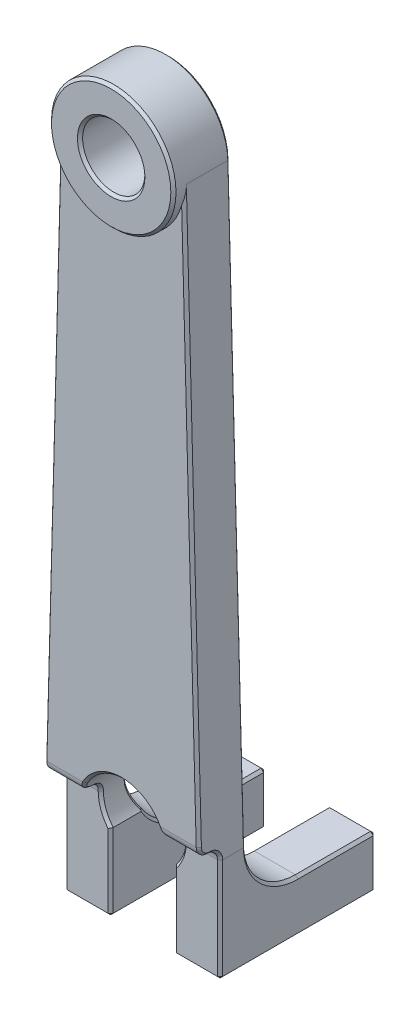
ISO-10303-21;
HEADER;
FILE_DESCRIPTION(('STEP AP214'),'2;1');
FILE_NAME('part.step','',(''),(''),'','','');
FILE_SCHEMA(('AUTOMOTIVE_DESIGN { 1 0 10303 214 1 1 1 1 }'));
ENDSEC;
DATA;
#1=APPLICATION_CONTEXT('core data for automotive mechanical design processes');
#2=APPLICATION_PROTOCOL_DEFINITION('international standard','automotive_design',2000,#1);
#3=PRODUCT_CONTEXT('',#1,'mechanical');
#4=PRODUCT('Part','Part','',(#3));
#5=PRODUCT_RELATED_PRODUCT_CATEGORY('part','',(#4));
#6=PRODUCT_DEFINITION_FORMATION('','',#4);
#7=PRODUCT_DEFINITION_CONTEXT('part definition',#1,'design');
#8=PRODUCT_DEFINITION('design','',#6,#7);
#9=PRODUCT_DEFINITION_SHAPE('','',#8);
#10=(LENGTH_UNIT() NAMED_UNIT(*) SI_UNIT(.MILLI.,.METRE.));
#11=(NAMED_UNIT(*) PLANE_ANGLE_UNIT() SI_UNIT($,.RADIAN.));
#12=(NAMED_UNIT(*) SI_UNIT($,.STERADIAN.) SOLID_ANGLE_UNIT());
#13=UNCERTAINTY_MEASURE_WITH_UNIT(LENGTH_MEASURE(1.E-05),#10,'distance_accuracy_value','');
#14=(GEOMETRIC_REPRESENTATION_CONTEXT(3) GLOBAL_UNCERTAINTY_ASSIGNED_CONTEXT((#13)) GLOBAL_UNIT_ASSIGNED_CONTEXT((#10,
#11,#12)) REPRESENTATION_CONTEXT('',''));
#15=CARTESIAN_POINT('',(0.,0.,0.));
#16=DIRECTION('',(0.,0.,1.));
#17=DIRECTION('',(1.,0.,0.));
#18=AXIS2_PLACEMENT_3D('',#15,#16,#17);
#19=CARTESIAN_POINT('',(0.,56.47,17.));
#20=DIRECTION('',(0.,0.,1.));
#21=DIRECTION('',(1.,0.,0.));
#22=AXIS2_PLACEMENT_3D('',#19,#20,#21);
#23=PLANE('',#22);
#24=CARTESIAN_POINT('',(0.,56.47,17.));
#25=DIRECTION('',(0.,0.,1.));
#26=DIRECTION('',(1.,0.,0.));
#27=AXIS2_PLACEMENT_3D('',#24,#25,#26);
#28=CIRCLE('',#27,6.);
#29=CARTESIAN_POINT('',(-5.79343981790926,54.9092133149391,17.));
#30=VERTEX_POINT('',#29);
#31=CARTESIAN_POINT('',(5.79343981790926,54.9092133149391,17.));
#32=VERTEX_POINT('',#31);
#33=EDGE_CURVE('E612',#30,#32,#28,.T.);
#34=ORIENTED_EDGE('',*,*,#33,.F.);
#35=DIRECTION('',(-0.0265258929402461,-0.999648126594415,0.));
#36=VECTOR('',#35,1.);
#37=CARTESIAN_POINT('',(-7.19757392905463,1.99336852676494,17.));
#38=LINE('',#37,#36);
#39=CARTESIAN_POINT('',(-7.19739796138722,2.00000000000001,17.));
#40=VERTEX_POINT('',#39);
#41=EDGE_CURVE('E441',#30,#40,#38,.T.);
#42=ORIENTED_EDGE('',*,*,#41,.T.);
#43=DIRECTION('',(1.,0.,0.));
#44=VECTOR('',#43,1.);
#45=CARTESIAN_POINT('',(-12.5,2.00000000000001,17.));
#46=LINE('',#45,#44);
#47=CARTESIAN_POINT('',(-3.74999999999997,2.00000000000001,17.));
#48=VERTEX_POINT('',#47);
#49=EDGE_CURVE('E364',#40,#48,#46,.T.);
#50=ORIENTED_EDGE('',*,*,#49,.T.);
#51=CARTESIAN_POINT('',(0.,0.,17.));
#52=DIRECTION('',(0.,0.,1.));
#53=DIRECTION('',(1.,0.,0.));
#54=AXIS2_PLACEMENT_3D('',#51,#52,#53);
#55=CIRCLE('',#54,4.25);
#56=CARTESIAN_POINT('',(3.75,2.00000000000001,17.));
#57=VERTEX_POINT('',#56);
#58=EDGE_CURVE('E600',#48,#57,#55,.F.);
#59=ORIENTED_EDGE('',*,*,#58,.T.);
#60=CARTESIAN_POINT('',(7.19739796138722,2.00000000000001,17.));
#61=VERTEX_POINT('',#60);
#62=EDGE_CURVE('E511',#57,#61,#46,.T.);
#63=ORIENTED_EDGE('',*,*,#62,.T.);
#64=DIRECTION('',(-0.026525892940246,0.999648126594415,0.));
#65=VECTOR('',#64,1.);
#66=CARTESIAN_POINT('',(5.74797672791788,56.6225238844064,17.));
#67=LINE('',#66,#65);
#68=EDGE_CURVE('E602',#61,#32,#67,.T.);
#69=ORIENTED_EDGE('',*,*,#68,.T.);
#70=EDGE_LOOP('',(#34,#42,#50,#59,#63,#69));
#71=FACE_BOUND('',#70,.T.);
#72=ADVANCED_FACE('F31',(#71),#23,.T.);
#73=CARTESIAN_POINT('',(0.,56.47,0.));
#74=DIRECTION('',(0.,0.,1.));
#75=DIRECTION('',(1.,0.,0.));
#76=AXIS2_PLACEMENT_3D('',#73,#74,#75);
#77=PLANE('',#76);
#78=DIRECTION('',(-1.,0.,0.));
#79=VECTOR('',#78,1.);
#80=CARTESIAN_POINT('',(0.,-9.75,0.));
#81=LINE('',#80,#79);
#82=CARTESIAN_POINT('',(-3.3,-9.75,0.));
#83=VERTEX_POINT('',#82);
#84=CARTESIAN_POINT('',(-7.25055642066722,-9.75,0.));
#85=VERTEX_POINT('',#84);
#86=EDGE_CURVE('E1506',#83,#85,#81,.T.);
#87=ORIENTED_EDGE('',*,*,#86,.T.);
#88=DIRECTION('',(0.,1.,0.));
#89=VECTOR('',#88,1.);
#90=CARTESIAN_POINT('',(-7.25055642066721,56.47,0.));
#91=LINE('',#90,#89);
#92=CARTESIAN_POINT('',(-7.25055642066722,-5.25,0.));
#93=VERTEX_POINT('',#92);
#94=EDGE_CURVE('E1508',#85,#93,#91,.T.);
#95=ORIENTED_EDGE('',*,*,#94,.T.);
#96=DIRECTION('',(1.,0.,0.));
#97=VECTOR('',#96,1.);
#98=CARTESIAN_POINT('',(0.,-5.25,0.));
#99=LINE('',#98,#97);
#100=CARTESIAN_POINT('',(-3.3,-5.25,0.));
#101=VERTEX_POINT('',#100);
#102=EDGE_CURVE('E1504',#93,#101,#99,.T.);
#103=ORIENTED_EDGE('',*,*,#102,.T.);
#104=DIRECTION('',(0.,-1.,0.));
#105=VECTOR('',#104,1.);
#106=CARTESIAN_POINT('',(-3.3,56.47,0.));
#107=LINE('',#106,#105);
#108=EDGE_CURVE('E1502',#101,#83,#107,.T.);
#109=ORIENTED_EDGE('',*,*,#108,.T.);
#110=EDGE_LOOP('',(#87,#95,#103,#109));
#111=FACE_BOUND('',#110,.T.);
#112=ADVANCED_FACE('F1646',(#111),#77,.F.);
#113=DIRECTION('',(0.,-1.,0.));
#114=VECTOR('',#113,1.);
#115=CARTESIAN_POINT('',(7.25055642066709,56.47,0.));
#116=LINE('',#115,#114);
#117=CARTESIAN_POINT('',(7.25055642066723,-5.25,0.));
#118=VERTEX_POINT('',#117);
#119=CARTESIAN_POINT('',(7.25055642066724,-9.75,0.));
#120=VERTEX_POINT('',#119);
#121=EDGE_CURVE('E1365',#118,#120,#116,.T.);
#122=ORIENTED_EDGE('',*,*,#121,.T.);
#123=DIRECTION('',(-1.,0.,0.));
#124=VECTOR('',#123,1.);
#125=CARTESIAN_POINT('',(0.,-9.75,0.));
#126=LINE('',#125,#124);
#127=CARTESIAN_POINT('',(3.3,-9.75,0.));
#128=VERTEX_POINT('',#127);
#129=EDGE_CURVE('E1362',#120,#128,#126,.T.);
#130=ORIENTED_EDGE('',*,*,#129,.T.);
#131=DIRECTION('',(0.,1.,0.));
#132=VECTOR('',#131,1.);
#133=CARTESIAN_POINT('',(3.3,56.47,0.));
#134=LINE('',#133,#132);
#135=CARTESIAN_POINT('',(3.3,-5.25,0.));
#136=VERTEX_POINT('',#135);
#137=EDGE_CURVE('E1369',#128,#136,#134,.T.);
#138=ORIENTED_EDGE('',*,*,#137,.T.);
#139=DIRECTION('',(1.,0.,0.));
#140=VECTOR('',#139,1.);
#141=CARTESIAN_POINT('',(0.,-5.25,0.));
#142=LINE('',#141,#140);
#143=EDGE_CURVE('E1367',#136,#118,#142,.T.);
#144=ORIENTED_EDGE('',*,*,#143,.T.);
#145=EDGE_LOOP('',(#122,#130,#138,#144));
#146=FACE_BOUND('',#145,.T.);
#147=ADVANCED_FACE('F1651',(#146),#77,.F.);
#148=CARTESIAN_POINT('',(3.05,-10.,17.));
#149=DIRECTION('',(0.,1.,0.));
#150=DIRECTION('',(0.,0.,1.));
#151=AXIS2_PLACEMENT_3D('',#148,#149,#150);
#152=PLANE('',#151);
#153=DIRECTION('',(0.,0.,1.));
#154=VECTOR('',#153,1.);
#155=CARTESIAN_POINT('',(7.25055642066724,-10.,17.));
#156=LINE('',#155,#154);
#157=CARTESIAN_POINT('',(7.25055642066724,-10.,0.25));
#158=VERTEX_POINT('',#157);
#159=CARTESIAN_POINT('',(7.25055642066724,-10.,14.75));
#160=VERTEX_POINT('',#159);
#161=EDGE_CURVE('E1374',#158,#160,#156,.T.);
#162=ORIENTED_EDGE('',*,*,#161,.T.);
#163=DIRECTION('',(-1.,0.,0.));
#164=VECTOR('',#163,1.);
#165=CARTESIAN_POINT('',(3.05,-10.,14.75));
#166=LINE('',#165,#164);
#167=CARTESIAN_POINT('',(3.3,-10.,14.75));
#168=VERTEX_POINT('',#167);
#169=EDGE_CURVE('E1371',#160,#168,#166,.T.);
#170=ORIENTED_EDGE('',*,*,#169,.T.);
#171=DIRECTION('',(0.,0.,-1.));
#172=VECTOR('',#171,1.);
#173=CARTESIAN_POINT('',(3.3,-10.,17.));
#174=LINE('',#173,#172);
#175=CARTESIAN_POINT('',(3.3,-10.,0.25));
#176=VERTEX_POINT('',#175);
#177=EDGE_CURVE('E1378',#168,#176,#174,.T.);
#178=ORIENTED_EDGE('',*,*,#177,.T.);
#179=DIRECTION('',(1.,0.,0.));
#180=VECTOR('',#179,1.);
#181=CARTESIAN_POINT('',(3.05,-10.,0.25));
#182=LINE('',#181,#180);
#183=EDGE_CURVE('E1376',#176,#158,#182,.T.);
#184=ORIENTED_EDGE('',*,*,#183,.T.);
#185=EDGE_LOOP('',(#162,#170,#178,#184));
#186=FACE_BOUND('',#185,.T.);
#187=ADVANCED_FACE('F1655',(#186),#152,.F.);
#188=CARTESIAN_POINT('',(7.50055642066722,0.,17.));
#189=DIRECTION('',(-1.,0.,0.));
#190=DIRECTION('',(0.,-1.,0.));
#191=AXIS2_PLACEMENT_3D('',#188,#189,#190);
#192=PLANE('',#191);
#193=DIRECTION('',(0.,0.,-1.));
#194=VECTOR('',#193,1.);
#195=CARTESIAN_POINT('',(7.50055642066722,0.,17.));
#196=LINE('',#195,#194);
#197=CARTESIAN_POINT('',(7.50055642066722,-0.017402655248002,14.7488668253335));
#198=VERTEX_POINT('',#197);
#199=CARTESIAN_POINT('',(7.50055642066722,0.,12.75));
#200=VERTEX_POINT('',#199);
#201=EDGE_CURVE('E427',#198,#200,#196,.T.);
#202=ORIENTED_EDGE('',*,*,#201,.F.);
#203=DIRECTION('',(0.,-1.,0.));
#204=VECTOR('',#203,1.);
#205=CARTESIAN_POINT('',(7.50055642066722,0.,14.75));
#206=LINE('',#205,#204);
#207=CARTESIAN_POINT('',(7.50055642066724,-9.75,14.75));
#208=VERTEX_POINT('',#207);
#209=EDGE_CURVE('E484',#198,#208,#206,.T.);
#210=ORIENTED_EDGE('',*,*,#209,.T.);
#211=DIRECTION('',(0.,0.,-1.));
#212=VECTOR('',#211,1.);
#213=CARTESIAN_POINT('',(7.50055642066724,-9.75,17.));
#214=LINE('',#213,#212);
#215=CARTESIAN_POINT('',(7.50055642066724,-9.75,0.25));
#216=VERTEX_POINT('',#215);
#217=EDGE_CURVE('E482',#208,#216,#214,.T.);
#218=ORIENTED_EDGE('',*,*,#217,.T.);
#219=DIRECTION('',(0.,1.,0.));
#220=VECTOR('',#219,1.);
#221=CARTESIAN_POINT('',(7.50055642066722,0.,0.25));
#222=LINE('',#221,#220);
#223=CARTESIAN_POINT('',(7.50055642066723,-5.25,0.25));
#224=VERTEX_POINT('',#223);
#225=EDGE_CURVE('E479',#216,#224,#222,.T.);
#226=ORIENTED_EDGE('',*,*,#225,.T.);
#227=DIRECTION('',(0.,0.,1.));
#228=VECTOR('',#227,1.);
#229=CARTESIAN_POINT('',(7.50055642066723,-5.25,17.));
#230=LINE('',#229,#228);
#231=CARTESIAN_POINT('',(7.50055642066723,-5.25,7.49999999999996));
#232=VERTEX_POINT('',#231);
#233=EDGE_CURVE('E472',#224,#232,#230,.T.);
#234=ORIENTED_EDGE('',*,*,#233,.T.);
#235=CARTESIAN_POINT('',(7.50055642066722,0.,7.49999999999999));
#236=DIRECTION('',(-1.,0.,0.));
#237=DIRECTION('',(0.,-1.,0.));
#238=AXIS2_PLACEMENT_3D('',#235,#236,#237);
#239=CIRCLE('',#238,5.25);
#240=EDGE_CURVE('E485',#232,#200,#239,.T.);
#241=ORIENTED_EDGE('',*,*,#240,.T.);
#242=EDGE_LOOP('',(#202,#210,#218,#226,#234,#241));
#243=FACE_BOUND('',#242,.T.);
#244=ADVANCED_FACE('F463',(#243),#192,.F.);
#245=CARTESIAN_POINT('',(7.50055642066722,0.,17.));
#246=DIRECTION('',(-0.999648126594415,-0.026525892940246,0.));
#247=DIRECTION('',(0.026525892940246,-0.999648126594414,0.));
#248=AXIS2_PLACEMENT_3D('',#245,#246,#247);
#249=PLANE('',#248);
#250=CARTESIAN_POINT('',(7.46721141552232,1.25663147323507,16.));
#251=CARTESIAN_POINT('',(7.46748612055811,1.24627900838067,16.4007593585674));
#252=CARTESIAN_POINT('',(7.45794423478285,1.60587211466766,16.7603524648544));
#253=CARTESIAN_POINT('',(7.44730999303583,2.00663147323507,16.75));
#254=B_SPLINE_CURVE_WITH_KNOTS('',3,(#250,#251,#252,#253),.UNSPECIFIED.,.F.,.F.,(4,4),(0.,
1.5707963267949),.UNSPECIFIED.);
#255=CARTESIAN_POINT('',(7.44730999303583,2.00663147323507,16.75));
#256=VERTEX_POINT('',#255);
#257=CARTESIAN_POINT('',(7.46721141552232,1.25663147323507,16.));
#258=VERTEX_POINT('',#257);
#259=EDGE_CURVE('E445',#256,#258,#254,.F.);
#260=ORIENTED_EDGE('',*,*,#259,.T.);
#261=CARTESIAN_POINT('',(7.50316702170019,-0.0983824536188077,14.7544189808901));
#262=CARTESIAN_POINT('',(7.48452495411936,0.604157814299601,14.6745381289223));
#263=CARTESIAN_POINT('',(7.46666539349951,1.27720872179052,15.2932324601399));
#264=CARTESIAN_POINT('',(7.46721141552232,1.25663147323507,16.));
#265=B_SPLINE_CURVE_WITH_KNOTS('',3,(#261,#262,#263,#264),.UNSPECIFIED.,.F.,.F.,(4,4),
(3.1415926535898,4.79649926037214),.UNSPECIFIED.);
#266=EDGE_CURVE('E480',#258,#198,#265,.F.);
#267=ORIENTED_EDGE('',*,*,#266,.T.);
#268=ORIENTED_EDGE('',*,*,#201,.T.);
#269=DIRECTION('',(-0.026525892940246,0.999648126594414,0.));
#270=VECTOR('',#269,1.);
#271=CARTESIAN_POINT('',(7.50055642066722,0.,12.75));
#272=LINE('',#271,#270);
#273=CARTESIAN_POINT('',(5.99788875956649,56.6291553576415,12.75));
#274=VERTEX_POINT('',#273);
#275=EDGE_CURVE('E438',#200,#274,#272,.T.);
#276=ORIENTED_EDGE('',*,*,#275,.T.);
#277=DIRECTION('',(0.,0.,-1.));
#278=VECTOR('',#277,1.);
#279=CARTESIAN_POINT('',(5.99788875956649,56.6291553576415,17.));
#280=LINE('',#279,#278);
#281=CARTESIAN_POINT('',(5.99788875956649,56.6291553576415,16.75));
#282=VERTEX_POINT('',#281);
#283=EDGE_CURVE('E424',#282,#274,#280,.T.);
#284=ORIENTED_EDGE('',*,*,#283,.F.);
#285=DIRECTION('',(0.026525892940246,-0.999648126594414,0.));
#286=VECTOR('',#285,1.);
#287=CARTESIAN_POINT('',(7.44748596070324,2.00000000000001,16.75));
#288=LINE('',#287,#286);
#289=EDGE_CURVE('E440',#282,#256,#288,.T.);
#290=ORIENTED_EDGE('',*,*,#289,.T.);
#291=EDGE_LOOP('',(#260,#267,#268,#276,#284,#290));
#292=FACE_BOUND('',#291,.T.);
#293=ADVANCED_FACE('F452',(#292),#249,.F.);
#294=CARTESIAN_POINT('',(0.,56.47,17.));
#295=DIRECTION('',(0.,0.,-1.));
#296=DIRECTION('',(-1.,0.,0.));
#297=AXIS2_PLACEMENT_3D('',#294,#295,#296);
#298=CYLINDRICAL_SURFACE('',#297,6.);
#299=CARTESIAN_POINT('',(0.,56.47,17.75));
#300=DIRECTION('',(0.,0.,1.));
#301=DIRECTION('',(1.,0.,0.));
#302=AXIS2_PLACEMENT_3D('',#299,#300,#301);
#303=CIRCLE('',#302,6.);
#304=CARTESIAN_POINT('',(6.,56.47,17.75));
#305=VERTEX_POINT('',#304);
#306=EDGE_CURVE('E407',#305,#305,#303,.F.);
#307=ORIENTED_EDGE('',*,*,#306,.T.);
#308=EDGE_LOOP('',(#307));
#309=FACE_BOUND('',#308,.T.);
#310=ORIENTED_EDGE('',*,*,#283,.T.);
#311=CARTESIAN_POINT('',(0.,56.47,12.75));
#312=DIRECTION('',(0.,0.,1.));
#313=DIRECTION('',(1.,0.,0.));
#314=AXIS2_PLACEMENT_3D('',#311,#312,#313);
#315=CIRCLE('',#314,6.);
#316=CARTESIAN_POINT('',(-5.99788875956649,56.6291553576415,12.75));
#317=VERTEX_POINT('',#316);
#318=EDGE_CURVE('E405',#274,#317,#315,.T.);
#319=ORIENTED_EDGE('',*,*,#318,.T.);
#320=DIRECTION('',(0.,0.,-1.));
#321=VECTOR('',#320,1.);
#322=CARTESIAN_POINT('',(-5.99788875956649,56.6291553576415,17.));
#323=LINE('',#322,#321);
#324=CARTESIAN_POINT('',(-5.99788875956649,56.6291553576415,16.75));
#325=VERTEX_POINT('',#324);
#326=EDGE_CURVE('E415',#325,#317,#323,.T.);
#327=ORIENTED_EDGE('',*,*,#326,.F.);
#328=CARTESIAN_POINT('',(0.,56.47,22.75));
#329=DIRECTION('',(-0.706857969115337,0.0187566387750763,0.707106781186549));
#330=DIRECTION('',(-0.70685796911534,0.0187566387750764,-0.707106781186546));
#331=AXIS2_PLACEMENT_3D('',#328,#329,#330);
#332=ELLIPSE('',#331,8.48528137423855,6.);
#333=EDGE_CURVE('E42',#325,#30,#332,.T.);
#334=ORIENTED_EDGE('',*,*,#333,.T.);
#335=ORIENTED_EDGE('',*,*,#33,.T.);
#336=CARTESIAN_POINT('',(0.,56.47,22.75));
#337=DIRECTION('',(0.706857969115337,0.0187566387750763,0.707106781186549));
#338=DIRECTION('',(0.70685796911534,0.0187566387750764,-0.707106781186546));
#339=AXIS2_PLACEMENT_3D('',#336,#337,#338);
#340=ELLIPSE('',#339,8.48528137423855,6.);
#341=EDGE_CURVE('E11',#32,#282,#340,.T.);
#342=ORIENTED_EDGE('',*,*,#341,.T.);
#343=EDGE_LOOP('',(#310,#319,#327,#334,#335,#342));
#344=FACE_BOUND('',#343,.T.);
#345=ADVANCED_FACE('F462',(#309,#344),#298,.T.);
#346=CARTESIAN_POINT('',(-7.50055642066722,0.,17.));
#347=DIRECTION('',(0.999648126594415,-0.0265258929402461,0.));
#348=DIRECTION('',(0.0265258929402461,0.999648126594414,0.));
#349=AXIS2_PLACEMENT_3D('',#346,#347,#348);
#350=PLANE('',#349);
#351=DIRECTION('',(0.,0.,-1.));
#352=VECTOR('',#351,1.);
#353=CARTESIAN_POINT('',(-7.50055642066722,0.,17.));
#354=LINE('',#353,#352);
#355=CARTESIAN_POINT('',(-7.50055642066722,-0.0074263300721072,14.748215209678));
#356=VERTEX_POINT('',#355);
#357=CARTESIAN_POINT('',(-7.50055642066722,0.,12.75));
#358=VERTEX_POINT('',#357);
#359=EDGE_CURVE('E411',#356,#358,#354,.T.);
#360=ORIENTED_EDGE('',*,*,#359,.F.);
#361=CARTESIAN_POINT('',(-7.46721141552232,1.25663147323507,16.));
#362=CARTESIAN_POINT('',(-7.46666539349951,1.27720872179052,15.2932324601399));
#363=CARTESIAN_POINT('',(-7.48452495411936,0.604157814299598,14.6745381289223));
#364=CARTESIAN_POINT('',(-7.50316702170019,-0.0983824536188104,14.7544189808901));
#365=B_SPLINE_CURVE_WITH_KNOTS('',3,(#361,#362,#363,#364),.UNSPECIFIED.,.F.,.F.,(4,4),
(4.62827870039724,6.28318530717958),.UNSPECIFIED.);
#366=CARTESIAN_POINT('',(-7.46721141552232,1.25663147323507,16.));
#367=VERTEX_POINT('',#366);
#368=EDGE_CURVE('E1170',#356,#367,#365,.F.);
#369=ORIENTED_EDGE('',*,*,#368,.T.);
#370=CARTESIAN_POINT('',(-7.44730999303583,2.00663147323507,16.75));
#371=CARTESIAN_POINT('',(-7.45794423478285,1.60587211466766,16.7603524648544));
#372=CARTESIAN_POINT('',(-7.46748612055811,1.24627900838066,16.4007593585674));
#373=CARTESIAN_POINT('',(-7.46721141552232,1.25663147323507,16.));
#374=B_SPLINE_CURVE_WITH_KNOTS('',3,(#370,#371,#372,#373),.UNSPECIFIED.,.F.,.F.,(4,4),
(1.57079632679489,3.1415926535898),.UNSPECIFIED.);
#375=CARTESIAN_POINT('',(-7.44730999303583,2.00663147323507,16.75));
#376=VERTEX_POINT('',#375);
#377=EDGE_CURVE('E1620',#367,#376,#374,.F.);
#378=ORIENTED_EDGE('',*,*,#377,.T.);
#379=DIRECTION('',(0.0265258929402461,0.999648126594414,0.));
#380=VECTOR('',#379,1.);
#381=CARTESIAN_POINT('',(-5.99788875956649,56.6291553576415,16.75));
#382=LINE('',#381,#380);
#383=EDGE_CURVE('E622',#376,#325,#382,.T.);
#384=ORIENTED_EDGE('',*,*,#383,.T.);
#385=ORIENTED_EDGE('',*,*,#326,.T.);
#386=DIRECTION('',(-0.0265258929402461,-0.999648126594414,0.));
#387=VECTOR('',#386,1.);
#388=CARTESIAN_POINT('',(-7.50055642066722,0.,12.75));
#389=LINE('',#388,#387);
#390=EDGE_CURVE('E410',#317,#358,#389,.T.);
#391=ORIENTED_EDGE('',*,*,#390,.T.);
#392=EDGE_LOOP('',(#360,#369,#378,#384,#385,#391));
#393=FACE_BOUND('',#392,.T.);
#394=ADVANCED_FACE('F1617',(#393),#350,.F.);
#395=CARTESIAN_POINT('',(-7.50055642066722,0.,17.));
#396=DIRECTION('',(1.,0.,0.));
#397=DIRECTION('',(0.,1.,0.));
#398=AXIS2_PLACEMENT_3D('',#395,#396,#397);
#399=PLANE('',#398);
#400=DIRECTION('',(0.,1.,0.));
#401=VECTOR('',#400,1.);
#402=CARTESIAN_POINT('',(-7.50055642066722,0.,14.75));
#403=LINE('',#402,#401);
#404=CARTESIAN_POINT('',(-7.50055642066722,-9.75,14.75));
#405=VERTEX_POINT('',#404);
#406=EDGE_CURVE('E565',#405,#356,#403,.T.);
#407=ORIENTED_EDGE('',*,*,#406,.T.);
#408=ORIENTED_EDGE('',*,*,#359,.T.);
#409=CARTESIAN_POINT('',(-7.50055642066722,0.,7.49999999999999));
#410=DIRECTION('',(1.,0.,0.));
#411=DIRECTION('',(0.,1.,0.));
#412=AXIS2_PLACEMENT_3D('',#409,#410,#411);
#413=CIRCLE('',#412,5.25);
#414=CARTESIAN_POINT('',(-7.50055642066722,-5.25,7.49999999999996));
#415=VERTEX_POINT('',#414);
#416=EDGE_CURVE('E566',#358,#415,#413,.T.);
#417=ORIENTED_EDGE('',*,*,#416,.T.);
#418=DIRECTION('',(0.,0.,-1.));
#419=VECTOR('',#418,1.);
#420=CARTESIAN_POINT('',(-7.50055642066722,-5.25,17.));
#421=LINE('',#420,#419);
#422=CARTESIAN_POINT('',(-7.50055642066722,-5.25,0.25));
#423=VERTEX_POINT('',#422);
#424=EDGE_CURVE('E553',#415,#423,#421,.T.);
#425=ORIENTED_EDGE('',*,*,#424,.T.);
#426=DIRECTION('',(0.,-1.,0.));
#427=VECTOR('',#426,1.);
#428=CARTESIAN_POINT('',(-7.50055642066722,0.,0.25));
#429=LINE('',#428,#427);
#430=CARTESIAN_POINT('',(-7.50055642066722,-9.75,0.25));
#431=VERTEX_POINT('',#430);
#432=EDGE_CURVE('E560',#423,#431,#429,.T.);
#433=ORIENTED_EDGE('',*,*,#432,.T.);
#434=DIRECTION('',(0.,0.,1.));
#435=VECTOR('',#434,1.);
#436=CARTESIAN_POINT('',(-7.50055642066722,-9.75,17.));
#437=LINE('',#436,#435);
#438=EDGE_CURVE('E563',#431,#405,#437,.T.);
#439=ORIENTED_EDGE('',*,*,#438,.T.);
#440=EDGE_LOOP('',(#407,#408,#417,#425,#433,#439));
#441=FACE_BOUND('',#440,.T.);
#442=ADVANCED_FACE('F1614',(#441),#399,.F.);
#443=CARTESIAN_POINT('',(-7.50055642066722,-10.,17.));
#444=DIRECTION('',(0.,1.,0.));
#445=DIRECTION('',(0.,0.,1.));
#446=AXIS2_PLACEMENT_3D('',#443,#444,#445);
#447=PLANE('',#446);
#448=DIRECTION('',(0.,0.,1.));
#449=VECTOR('',#448,1.);
#450=CARTESIAN_POINT('',(-3.3,-10.,17.));
#451=LINE('',#450,#449);
#452=CARTESIAN_POINT('',(-3.3,-10.,0.25));
#453=VERTEX_POINT('',#452);
#454=CARTESIAN_POINT('',(-3.3,-10.,14.75));
#455=VERTEX_POINT('',#454);
#456=EDGE_CURVE('E1491',#453,#455,#451,.T.);
#457=ORIENTED_EDGE('',*,*,#456,.T.);
#458=DIRECTION('',(-1.,0.,0.));
#459=VECTOR('',#458,1.);
#460=CARTESIAN_POINT('',(-7.50055642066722,-10.,14.75));
#461=LINE('',#460,#459);
#462=CARTESIAN_POINT('',(-7.25055642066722,-10.,14.75));
#463=VERTEX_POINT('',#462);
#464=EDGE_CURVE('E1499',#455,#463,#461,.T.);
#465=ORIENTED_EDGE('',*,*,#464,.T.);
#466=DIRECTION('',(0.,0.,-1.));
#467=VECTOR('',#466,1.);
#468=CARTESIAN_POINT('',(-7.25055642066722,-10.,17.));
#469=LINE('',#468,#467);
#470=CARTESIAN_POINT('',(-7.25055642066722,-10.,0.25));
#471=VERTEX_POINT('',#470);
#472=EDGE_CURVE('E1497',#463,#471,#469,.T.);
#473=ORIENTED_EDGE('',*,*,#472,.T.);
#474=DIRECTION('',(1.,0.,0.));
#475=VECTOR('',#474,1.);
#476=CARTESIAN_POINT('',(-7.50055642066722,-10.,0.25));
#477=LINE('',#476,#475);
#478=EDGE_CURVE('E1495',#471,#453,#477,.T.);
#479=ORIENTED_EDGE('',*,*,#478,.T.);
#480=EDGE_LOOP('',(#457,#465,#473,#479));
#481=FACE_BOUND('',#480,.T.);
#482=ADVANCED_FACE('F1639',(#481),#447,.F.);
#483=CARTESIAN_POINT('',(-3.05,-2.58795285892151,17.));
#484=DIRECTION('',(-1.,0.,0.));
#485=DIRECTION('',(0.,-1.,0.));
#486=AXIS2_PLACEMENT_3D('',#483,#484,#485);
#487=PLANE('',#486);
#488=DIRECTION('',(0.,0.,-1.));
#489=VECTOR('',#488,1.);
#490=CARTESIAN_POINT('',(-3.05,-2.58795285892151,17.));
#491=LINE('',#490,#489);
#492=CARTESIAN_POINT('',(-3.05,-2.58795285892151,14.75));
#493=VERTEX_POINT('',#492);
#494=CARTESIAN_POINT('',(-3.05,-2.58795285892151,12.0678222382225));
#495=VERTEX_POINT('',#494);
#496=EDGE_CURVE('E416',#493,#495,#491,.T.);
#497=ORIENTED_EDGE('',*,*,#496,.F.);
#498=DIRECTION('',(0.,-1.,0.));
#499=VECTOR('',#498,1.);
#500=CARTESIAN_POINT('',(-3.05,-2.58795285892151,14.75));
#501=LINE('',#500,#499);
#502=CARTESIAN_POINT('',(-3.05,-9.75,14.75));
#503=VERTEX_POINT('',#502);
#504=EDGE_CURVE('E50',#493,#503,#501,.T.);
#505=ORIENTED_EDGE('',*,*,#504,.T.);
#506=DIRECTION('',(0.,0.,-1.));
#507=VECTOR('',#506,1.);
#508=CARTESIAN_POINT('',(-3.05,-9.75,17.));
#509=LINE('',#508,#507);
#510=CARTESIAN_POINT('',(-3.05,-9.75,0.25));
#511=VERTEX_POINT('',#510);
#512=EDGE_CURVE('E54',#503,#511,#509,.T.);
#513=ORIENTED_EDGE('',*,*,#512,.T.);
#514=DIRECTION('',(0.,1.,0.));
#515=VECTOR('',#514,1.);
#516=CARTESIAN_POINT('',(-3.05,-2.58795285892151,0.25));
#517=LINE('',#516,#515);
#518=CARTESIAN_POINT('',(-3.05,-5.25,0.25));
#519=VERTEX_POINT('',#518);
#520=EDGE_CURVE('E1521',#511,#519,#517,.T.);
#521=ORIENTED_EDGE('',*,*,#520,.T.);
#522=DIRECTION('',(0.,0.,1.));
#523=VECTOR('',#522,1.);
#524=CARTESIAN_POINT('',(-3.05,-5.25,17.));
#525=LINE('',#524,#523);
#526=CARTESIAN_POINT('',(-3.05,-5.25,7.49999999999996));
#527=VERTEX_POINT('',#526);
#528=EDGE_CURVE('E1519',#519,#527,#525,.T.);
#529=ORIENTED_EDGE('',*,*,#528,.T.);
#530=CARTESIAN_POINT('',(-3.05,0.,7.49999999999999));
#531=DIRECTION('',(-1.,0.,0.));
#532=DIRECTION('',(0.,-1.,0.));
#533=AXIS2_PLACEMENT_3D('',#530,#531,#532);
#534=CIRCLE('',#533,5.25);
#535=EDGE_CURVE('E1517',#527,#495,#534,.T.);
#536=ORIENTED_EDGE('',*,*,#535,.T.);
#537=EDGE_LOOP('',(#497,#505,#513,#521,#529,#536));
#538=FACE_BOUND('',#537,.T.);
#539=ADVANCED_FACE('F1242',(#538),#487,.F.);
#540=CARTESIAN_POINT('',(0.,0.,17.));
#541=DIRECTION('',(0.,0.,-1.));
#542=DIRECTION('',(-1.,0.,0.));
#543=AXIS2_PLACEMENT_3D('',#540,#541,#542);
#544=CYLINDRICAL_SURFACE('',#543,4.);
#545=DIRECTION('',(0.,0.,-1.));
#546=VECTOR('',#545,1.);
#547=CARTESIAN_POINT('',(3.05,-2.58795285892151,17.));
#548=LINE('',#547,#546);
#549=CARTESIAN_POINT('',(3.05,-2.58795285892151,14.75));
#550=VERTEX_POINT('',#549);
#551=CARTESIAN_POINT('',(3.05,-2.58795285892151,12.0678222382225));
#552=VERTEX_POINT('',#551);
#553=EDGE_CURVE('E1712',#550,#552,#548,.T.);
#554=ORIENTED_EDGE('',*,*,#553,.F.);
#555=CARTESIAN_POINT('',(0.,0.,14.75));
#556=DIRECTION('',(0.,0.,-1.));
#557=DIRECTION('',(-1.,0.,0.));
#558=AXIS2_PLACEMENT_3D('',#555,#556,#557);
#559=CIRCLE('',#558,4.);
#560=CARTESIAN_POINT('',(4.,0.,14.75));
#561=VERTEX_POINT('',#560);
#562=EDGE_CURVE('E1477',#550,#561,#559,.F.);
#563=ORIENTED_EDGE('',*,*,#562,.T.);
#564=CARTESIAN_POINT('',(3.82307689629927,1.17647058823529,16.));
#565=CARTESIAN_POINT('',(3.81941758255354,1.18897762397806,15.3257591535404));
#566=CARTESIAN_POINT('',(4.00601507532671,0.632400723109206,14.7368910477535));
#567=CARTESIAN_POINT('',(4.,0.,14.75));
#568=B_SPLINE_CURVE_WITH_KNOTS('',3,(#564,#565,#566,#567),.UNSPECIFIED.,.F.,.F.,(4,4),(0.,
0.00196365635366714),.UNSPECIFIED.);
#569=CARTESIAN_POINT('',(3.82307689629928,1.17647058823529,16.));
#570=VERTEX_POINT('',#569);
#571=EDGE_CURVE('E1475',#561,#570,#568,.F.);
#572=ORIENTED_EDGE('',*,*,#571,.T.);
#573=CARTESIAN_POINT('',(3.52941176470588,1.88235294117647,16.75));
#574=CARTESIAN_POINT('',(3.7163445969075,1.53943297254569,16.7677276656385));
#575=CARTESIAN_POINT('',(3.82667052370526,1.16700234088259,16.4271756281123));
#576=CARTESIAN_POINT('',(3.82307689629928,1.17647058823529,16.));
#577=B_SPLINE_CURVE_WITH_KNOTS('',3,(#573,#574,#575,#576),.UNSPECIFIED.,.F.,.F.,(4,4),(0.,
0.00122562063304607),.UNSPECIFIED.);
#578=CARTESIAN_POINT('',(3.52941176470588,1.88235294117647,16.75));
#579=VERTEX_POINT('',#578);
#580=EDGE_CURVE('E1474',#570,#579,#577,.F.);
#581=ORIENTED_EDGE('',*,*,#580,.T.);
#582=CARTESIAN_POINT('',(0.,0.,16.75));
#583=DIRECTION('',(0.,0.,1.));
#584=DIRECTION('',(1.,0.,0.));
#585=AXIS2_PLACEMENT_3D('',#582,#583,#584);
#586=CIRCLE('',#585,4.);
#587=CARTESIAN_POINT('',(-3.52941176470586,1.88235294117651,16.75));
#588=VERTEX_POINT('',#587);
#589=EDGE_CURVE('E1213',#579,#588,#586,.T.);
#590=ORIENTED_EDGE('',*,*,#589,.T.);
#591=CARTESIAN_POINT('',(-3.82307689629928,1.17647058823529,16.));
#592=CARTESIAN_POINT('',(-3.8264304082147,1.16788027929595,16.4301219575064));
#593=CARTESIAN_POINT('',(-3.71593457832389,1.54027281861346,16.7669651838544));
#594=CARTESIAN_POINT('',(-3.52941176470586,1.88235294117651,16.75));
#595=B_SPLINE_CURVE_WITH_KNOTS('',3,(#591,#592,#593,#594),.UNSPECIFIED.,.F.,.F.,(4,4),(0.,
0.00122539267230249),.UNSPECIFIED.);
#596=CARTESIAN_POINT('',(-3.82307689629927,1.17647058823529,16.));
#597=VERTEX_POINT('',#596);
#598=EDGE_CURVE('E1208',#588,#597,#595,.F.);
#599=ORIENTED_EDGE('',*,*,#598,.T.);
#600=CARTESIAN_POINT('',(-4.,0.,14.75));
#601=CARTESIAN_POINT('',(-4.00582154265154,0.634766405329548,14.7367836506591));
#602=CARTESIAN_POINT('',(-3.81921260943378,1.18887385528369,15.3282694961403));
#603=CARTESIAN_POINT('',(-3.82307689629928,1.17647058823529,16.));
#604=B_SPLINE_CURVE_WITH_KNOTS('',3,(#600,#601,#602,#603),.UNSPECIFIED.,.F.,.F.,(4,4),(0.,
0.00196361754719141),.UNSPECIFIED.);
#605=CARTESIAN_POINT('',(-4.,0.,14.75));
#606=VERTEX_POINT('',#605);
#607=EDGE_CURVE('E1209',#597,#606,#604,.F.);
#608=ORIENTED_EDGE('',*,*,#607,.T.);
#609=CARTESIAN_POINT('',(0.,0.,14.75));
#610=DIRECTION('',(0.,0.,-1.));
#611=DIRECTION('',(-1.,0.,0.));
#612=AXIS2_PLACEMENT_3D('',#609,#610,#611);
#613=CIRCLE('',#612,4.);
#614=EDGE_CURVE('E1212',#606,#493,#613,.F.);
#615=ORIENTED_EDGE('',*,*,#614,.T.);
#616=ORIENTED_EDGE('',*,*,#496,.T.);
#617=CARTESIAN_POINT('',(-3.05,-2.58795285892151,12.0678222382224));
#618=CARTESIAN_POINT('',(-3.06272406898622,-2.57295885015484,12.0616958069));
#619=CARTESIAN_POINT('',(-3.07536047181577,-2.55784135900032,12.0557028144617));
#620=CARTESIAN_POINT('',(-3.10045794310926,-2.52735941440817,12.0439837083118));
#621=CARTESIAN_POINT('',(-3.11291901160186,-2.51199496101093,12.0382575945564));
#622=CARTESIAN_POINT('',(-3.12529241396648,-2.49650702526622,12.0326649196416));
#623=B_SPLINE_CURVE_WITH_KNOTS('',3,(#617,#618,#619,#620,#621,#622),.UNSPECIFIED.,.F.,.F.,(4,2,
4),(0.,0.0617834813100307,0.123566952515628),.UNSPECIFIED.);
#624=CARTESIAN_POINT('',(-3.12547953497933,-2.4970656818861,12.0315318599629));
#625=VERTEX_POINT('',#624);
#626=EDGE_CURVE('E1214',#495,#625,#623,.T.);
#627=ORIENTED_EDGE('',*,*,#626,.T.);
#628=CARTESIAN_POINT('',(-3.99712016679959,0.151757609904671,12.7475233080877));
#629=CARTESIAN_POINT('',(-4.04301433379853,-0.914550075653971,12.7904258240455));
#630=CARTESIAN_POINT('',(-3.63141008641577,-1.93857090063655,12.4201467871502));
#631=CARTESIAN_POINT('',(-3.00475326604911,-2.6403518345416,11.9376094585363));
#632=B_SPLINE_CURVE_WITH_KNOTS('',3,(#628,#629,#630,#631),.UNSPECIFIED.,.F.,.F.,(4,4),
(0.0147406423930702,0.0180727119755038),.UNSPECIFIED.);
#633=CARTESIAN_POINT('',(-4.00029485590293,2.42196200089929E-06,12.7508729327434));
#634=VERTEX_POINT('',#633);
#635=EDGE_CURVE('E1338',#625,#634,#632,.F.);
#636=ORIENTED_EDGE('',*,*,#635,.T.);
#637=CARTESIAN_POINT('',(0.,0.,12.75));
#638=DIRECTION('',(0.,0.,1.));
#639=DIRECTION('',(1.,0.,0.));
#640=AXIS2_PLACEMENT_3D('',#637,#638,#639);
#641=CIRCLE('',#640,4.);
#642=CARTESIAN_POINT('',(4.,0.,12.75));
#643=VERTEX_POINT('',#642);
#644=EDGE_CURVE('E1340',#634,#643,#641,.F.);
#645=ORIENTED_EDGE('',*,*,#644,.T.);
#646=CARTESIAN_POINT('',(2.91410502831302,-2.7400715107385,11.8688306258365));
#647=CARTESIAN_POINT('',(3.55900524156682,-2.06508412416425,12.3579051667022));
#648=CARTESIAN_POINT('',(4.00496687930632,-1.06391897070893,12.7576449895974));
#649=CARTESIAN_POINT('',(4.,0.,12.75));
#650=B_SPLINE_CURVE_WITH_KNOTS('',3,(#646,#647,#648,#649),.UNSPECIFIED.,.F.,.F.,(4,4),
(0.0148993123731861,0.0182313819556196),.UNSPECIFIED.);
#651=CARTESIAN_POINT('',(3.1251603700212,-2.49764314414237,12.0314406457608));
#652=VERTEX_POINT('',#651);
#653=EDGE_CURVE('E371',#643,#652,#650,.F.);
#654=ORIENTED_EDGE('',*,*,#653,.T.);
#655=CARTESIAN_POINT('',(3.12493143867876,-2.49695885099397,12.0328281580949));
#656=CARTESIAN_POINT('',(3.11261645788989,-2.51236910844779,12.0383962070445));
#657=CARTESIAN_POINT('',(3.10021468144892,-2.52765707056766,12.0440964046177));
#658=CARTESIAN_POINT('',(3.07523753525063,-2.55798840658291,12.055761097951));
#659=CARTESIAN_POINT('',(3.06266216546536,-2.57303178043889,12.0617255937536));
#660=CARTESIAN_POINT('',(3.05,-2.58795285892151,12.0678222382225));
#661=B_SPLINE_CURVE_WITH_KNOTS('',3,(#655,#656,#657,#658,#659,#660),.UNSPECIFIED.,.F.,.F.,(4,2,
4),(0.,0.0614830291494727,0.122966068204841),.UNSPECIFIED.);
#662=EDGE_CURVE('E1217',#652,#552,#661,.T.);
#663=ORIENTED_EDGE('',*,*,#662,.T.);
#664=EDGE_LOOP('',(#554,#563,#572,#581,#590,#599,#608,#615,#616,#627,#636,#645,#654,#663));
#665=FACE_BOUND('',#664,.T.);
#666=ADVANCED_FACE('F1231',(#665),#544,.F.);
#667=CARTESIAN_POINT('',(3.05,-2.58795285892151,17.));
#668=DIRECTION('',(1.,0.,0.));
#669=DIRECTION('',(0.,1.,0.));
#670=AXIS2_PLACEMENT_3D('',#667,#668,#669);
#671=PLANE('',#670);
#672=DIRECTION('',(0.,0.,1.));
#673=VECTOR('',#672,1.);
#674=CARTESIAN_POINT('',(3.05,-9.75,17.));
#675=LINE('',#674,#673);
#676=CARTESIAN_POINT('',(3.05,-9.75,0.25));
#677=VERTEX_POINT('',#676);
#678=CARTESIAN_POINT('',(3.05,-9.75,14.75));
#679=VERTEX_POINT('',#678);
#680=EDGE_CURVE('E1342',#677,#679,#675,.T.);
#681=ORIENTED_EDGE('',*,*,#680,.T.);
#682=DIRECTION('',(0.,1.,0.));
#683=VECTOR('',#682,1.);
#684=CARTESIAN_POINT('',(3.05,-2.58795285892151,14.75));
#685=LINE('',#684,#683);
#686=EDGE_CURVE('E1341',#679,#550,#685,.T.);
#687=ORIENTED_EDGE('',*,*,#686,.T.);
#688=ORIENTED_EDGE('',*,*,#553,.T.);
#689=CARTESIAN_POINT('',(3.05,0.,7.49999999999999));
#690=DIRECTION('',(1.,0.,0.));
#691=DIRECTION('',(0.,1.,0.));
#692=AXIS2_PLACEMENT_3D('',#689,#690,#691);
#693=CIRCLE('',#692,5.24999999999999);
#694=CARTESIAN_POINT('',(3.05,-5.24999999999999,7.49999999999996));
#695=VERTEX_POINT('',#694);
#696=EDGE_CURVE('E1335',#552,#695,#693,.T.);
#697=ORIENTED_EDGE('',*,*,#696,.T.);
#698=DIRECTION('',(0.,0.,-1.));
#699=VECTOR('',#698,1.);
#700=CARTESIAN_POINT('',(3.05,-5.24999999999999,17.));
#701=LINE('',#700,#699);
#702=CARTESIAN_POINT('',(3.05,-5.24999999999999,0.25));
#703=VERTEX_POINT('',#702);
#704=EDGE_CURVE('E1353',#695,#703,#701,.T.);
#705=ORIENTED_EDGE('',*,*,#704,.T.);
#706=DIRECTION('',(0.,-1.,0.));
#707=VECTOR('',#706,1.);
#708=CARTESIAN_POINT('',(3.05,-2.58795285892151,0.25));
#709=LINE('',#708,#707);
#710=EDGE_CURVE('E1348',#703,#677,#709,.T.);
#711=ORIENTED_EDGE('',*,*,#710,.T.);
#712=EDGE_LOOP('',(#681,#687,#688,#697,#705,#711));
#713=FACE_BOUND('',#712,.T.);
#714=ADVANCED_FACE('F1241',(#713),#671,.F.);
#715=CARTESIAN_POINT('',(0.,56.47,17.));
#716=DIRECTION('',(0.,0.,-1.));
#717=DIRECTION('',(-1.,0.,0.));
#718=AXIS2_PLACEMENT_3D('',#715,#716,#717);
#719=CYLINDRICAL_SURFACE('',#718,3.);
#720=CARTESIAN_POINT('',(0.,56.47,17.75));
#721=DIRECTION('',(0.,0.,1.));
#722=DIRECTION('',(1.,0.,0.));
#723=AXIS2_PLACEMENT_3D('',#720,#721,#722);
#724=CIRCLE('',#723,3.);
#725=CARTESIAN_POINT('',(3.,56.47,17.75));
#726=VERTEX_POINT('',#725);
#727=EDGE_CURVE('E1717',#726,#726,#724,.T.);
#728=ORIENTED_EDGE('',*,*,#727,.T.);
#729=EDGE_LOOP('',(#728));
#730=FACE_BOUND('',#729,.T.);
#731=CARTESIAN_POINT('',(0.,56.47,12.75));
#732=DIRECTION('',(0.,0.,1.));
#733=DIRECTION('',(1.,0.,0.));
#734=AXIS2_PLACEMENT_3D('',#731,#732,#733);
#735=CIRCLE('',#734,3.);
#736=CARTESIAN_POINT('',(3.,56.47,12.75));
#737=VERTEX_POINT('',#736);
#738=EDGE_CURVE('E430',#737,#737,#735,.F.);
#739=ORIENTED_EDGE('',*,*,#738,.T.);
#740=EDGE_LOOP('',(#739));
#741=FACE_BOUND('',#740,.T.);
#742=ADVANCED_FACE('F1653',(#730,#741),#719,.F.);
#743=CARTESIAN_POINT('',(-12.5,-5.,7.49999999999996));
#744=DIRECTION('',(0.,-1.,0.));
#745=DIRECTION('',(0.,0.,-1.));
#746=AXIS2_PLACEMENT_3D('',#743,#744,#745);
#747=PLANE('',#746);
#748=DIRECTION('',(1.,0.,0.));
#749=VECTOR('',#748,1.);
#750=CARTESIAN_POINT('',(-12.5,-5.,7.49999999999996));
#751=LINE('',#750,#749);
#752=CARTESIAN_POINT('',(3.29999999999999,-5.,7.49999999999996));
#753=VERTEX_POINT('',#752);
#754=CARTESIAN_POINT('',(7.25055642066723,-5.,7.49999999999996));
#755=VERTEX_POINT('',#754);
#756=EDGE_CURVE('E1436',#753,#755,#751,.T.);
#757=ORIENTED_EDGE('',*,*,#756,.T.);
#758=DIRECTION('',(0.,0.,-1.));
#759=VECTOR('',#758,1.);
#760=CARTESIAN_POINT('',(7.25055642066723,-5.,7.49999999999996));
#761=LINE('',#760,#759);
#762=CARTESIAN_POINT('',(7.25055642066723,-5.,0.25));
#763=VERTEX_POINT('',#762);
#764=EDGE_CURVE('E1356',#755,#763,#761,.T.);
#765=ORIENTED_EDGE('',*,*,#764,.T.);
#766=DIRECTION('',(-1.,0.,0.));
#767=VECTOR('',#766,1.);
#768=CARTESIAN_POINT('',(-12.5,-5.,0.25));
#769=LINE('',#768,#767);
#770=CARTESIAN_POINT('',(3.29999999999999,-5.,0.25));
#771=VERTEX_POINT('',#770);
#772=EDGE_CURVE('E1358',#763,#771,#769,.T.);
#773=ORIENTED_EDGE('',*,*,#772,.T.);
#774=DIRECTION('',(0.,0.,1.));
#775=VECTOR('',#774,1.);
#776=CARTESIAN_POINT('',(3.29999999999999,-5.,7.49999999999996));
#777=LINE('',#776,#775);
#778=EDGE_CURVE('E1360',#771,#753,#777,.T.);
#779=ORIENTED_EDGE('',*,*,#778,.T.);
#780=EDGE_LOOP('',(#757,#765,#773,#779));
#781=FACE_BOUND('',#780,.T.);
#782=ADVANCED_FACE('F1411',(#781),#747,.F.);
#783=DIRECTION('',(-1.,0.,0.));
#784=VECTOR('',#783,1.);
#785=CARTESIAN_POINT('',(-12.5,-5.,0.25));
#786=LINE('',#785,#784);
#787=CARTESIAN_POINT('',(-3.29999999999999,-5.,0.25));
#788=VERTEX_POINT('',#787);
#789=CARTESIAN_POINT('',(-7.25055642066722,-5.,0.25));
#790=VERTEX_POINT('',#789);
#791=EDGE_CURVE('E1513',#788,#790,#786,.T.);
#792=ORIENTED_EDGE('',*,*,#791,.T.);
#793=DIRECTION('',(0.,0.,1.));
#794=VECTOR('',#793,1.);
#795=CARTESIAN_POINT('',(-7.25055642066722,-5.,7.49999999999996));
#796=LINE('',#795,#794);
#797=CARTESIAN_POINT('',(-7.25055642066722,-5.,7.49999999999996));
#798=VERTEX_POINT('',#797);
#799=EDGE_CURVE('E1515',#790,#798,#796,.T.);
#800=ORIENTED_EDGE('',*,*,#799,.T.);
#801=CARTESIAN_POINT('',(-3.29999999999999,-5.,7.49999999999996));
#802=VERTEX_POINT('',#801);
#803=EDGE_CURVE('E1711',#798,#802,#751,.T.);
#804=ORIENTED_EDGE('',*,*,#803,.T.);
#805=DIRECTION('',(0.,0.,-1.));
#806=VECTOR('',#805,1.);
#807=CARTESIAN_POINT('',(-3.29999999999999,-5.,7.49999999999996));
#808=LINE('',#807,#806);
#809=EDGE_CURVE('E1511',#802,#788,#808,.T.);
#810=ORIENTED_EDGE('',*,*,#809,.T.);
#811=EDGE_LOOP('',(#792,#800,#804,#810));
#812=FACE_BOUND('',#811,.T.);
#813=ADVANCED_FACE('F1410',(#812),#747,.F.);
#814=CARTESIAN_POINT('',(-12.5,0.,7.49999999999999));
#815=DIRECTION('',(1.,0.,0.));
#816=DIRECTION('',(0.,0.,-1.));
#817=AXIS2_PLACEMENT_3D('',#814,#815,#816);
#818=CYLINDRICAL_SURFACE('',#817,5.);
#819=DIRECTION('',(1.,0.,0.));
#820=VECTOR('',#819,1.);
#821=CARTESIAN_POINT('',(-12.5,0.,12.5));
#822=LINE('',#821,#820);
#823=CARTESIAN_POINT('',(4.25,0.,12.5));
#824=VERTEX_POINT('',#823);
#825=CARTESIAN_POINT('',(7.2504684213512,0.,12.5));
#826=VERTEX_POINT('',#825);
#827=EDGE_CURVE('E342',#824,#826,#822,.T.);
#828=ORIENTED_EDGE('',*,*,#827,.T.);
#829=CARTESIAN_POINT('',(2.2487084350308,0.,7.49999999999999));
#830=DIRECTION('',(-0.706857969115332,-0.0187566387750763,0.707106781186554));
#831=DIRECTION('',(0.707355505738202,-0.0187434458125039,0.706609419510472));
#832=AXIS2_PLACEMENT_3D('',#829,#830,#831);
#833=ELLIPSE('',#832,7.07355680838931,5.);
#834=CARTESIAN_POINT('',(7.25055642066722,-0.00335885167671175,12.4999988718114));
#835=VERTEX_POINT('',#834);
#836=EDGE_CURVE('E1392',#826,#835,#833,.F.);
#837=ORIENTED_EDGE('',*,*,#836,.T.);
#838=CARTESIAN_POINT('',(7.25055642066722,0.,7.49999999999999));
#839=DIRECTION('',(-1.,0.,0.));
#840=DIRECTION('',(0.,0.,1.));
#841=AXIS2_PLACEMENT_3D('',#838,#839,#840);
#842=CIRCLE('',#841,5.);
#843=EDGE_CURVE('E1394',#835,#755,#842,.F.);
#844=ORIENTED_EDGE('',*,*,#843,.T.);
#845=ORIENTED_EDGE('',*,*,#756,.F.);
#846=CARTESIAN_POINT('',(3.29999999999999,0.,7.49999999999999));
#847=DIRECTION('',(1.,0.,0.));
#848=DIRECTION('',(0.,0.,-1.));
#849=AXIS2_PLACEMENT_3D('',#846,#847,#848);
#850=CIRCLE('',#849,5.);
#851=CARTESIAN_POINT('',(3.30065656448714,-2.55139969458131,11.8008677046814));
#852=VERTEX_POINT('',#851);
#853=EDGE_CURVE('E346',#753,#852,#850,.F.);
#854=ORIENTED_EDGE('',*,*,#853,.T.);
#855=CARTESIAN_POINT('',(4.25,0.,12.5));
#856=CARTESIAN_POINT('',(4.25527730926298,-1.07658467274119,12.5072809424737));
#857=CARTESIAN_POINT('',(3.78144306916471,-2.08966845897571,12.1265763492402));
#858=CARTESIAN_POINT('',(3.09623659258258,-2.77269140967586,11.6607910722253));
#859=B_SPLINE_CURVE_WITH_KNOTS('',3,(#855,#856,#857,#858),.UNSPECIFIED.,.F.,.F.,(4,4),
(0.0148993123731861,0.0182313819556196),.UNSPECIFIED.);
#860=EDGE_CURVE('E338',#852,#824,#859,.F.);
#861=ORIENTED_EDGE('',*,*,#860,.T.);
#862=EDGE_LOOP('',(#828,#837,#844,#845,#854,#861));
#863=FACE_BOUND('',#862,.T.);
#864=ADVANCED_FACE('F341',(#863),#818,.F.);
#865=CARTESIAN_POINT('',(-7.25055642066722,0.,7.49999999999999));
#866=DIRECTION('',(1.,0.,0.));
#867=DIRECTION('',(0.,0.,-1.));
#868=AXIS2_PLACEMENT_3D('',#865,#866,#867);
#869=CIRCLE('',#868,5.);
#870=CARTESIAN_POINT('',(-7.25055642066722,-0.00335885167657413,12.4999988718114));
#871=VERTEX_POINT('',#870);
#872=EDGE_CURVE('E1427',#798,#871,#869,.F.);
#873=ORIENTED_EDGE('',*,*,#872,.T.);
#874=CARTESIAN_POINT('',(-2.2487084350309,0.,7.49999999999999));
#875=DIRECTION('',(0.706857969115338,-0.0187566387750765,0.707106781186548));
#876=DIRECTION('',(0.707355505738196,0.0187434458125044,-0.706609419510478));
#877=AXIS2_PLACEMENT_3D('',#874,#875,#876);
#878=ELLIPSE('',#877,7.07355680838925,5.);
#879=CARTESIAN_POINT('',(-7.25046842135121,0.,12.5));
#880=VERTEX_POINT('',#879);
#881=EDGE_CURVE('E352',#871,#880,#878,.F.);
#882=ORIENTED_EDGE('',*,*,#881,.T.);
#883=CARTESIAN_POINT('',(-4.25062657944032,2.49684025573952E-06,12.5004156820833));
#884=VERTEX_POINT('',#883);
#885=EDGE_CURVE('E363',#880,#884,#822,.T.);
#886=ORIENTED_EDGE('',*,*,#885,.T.);
#887=CARTESIAN_POINT('',(-3.19255034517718,-2.67178459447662,11.7262947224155));
#888=CARTESIAN_POINT('',(-3.85837321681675,-1.96164912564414,12.1858540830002));
#889=CARTESIAN_POINT('',(-4.29570272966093,-0.925437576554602,12.5385007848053));
#890=CARTESIAN_POINT('',(-4.24694017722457,0.153564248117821,12.4976412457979));
#891=B_SPLINE_CURVE_WITH_KNOTS('',3,(#887,#888,#889,#890),.UNSPECIFIED.,.F.,.F.,(4,4),
(0.0147406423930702,0.0180727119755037),.UNSPECIFIED.);
#892=CARTESIAN_POINT('',(-3.30024271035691,-2.55077720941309,11.8004110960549));
#893=VERTEX_POINT('',#892);
#894=EDGE_CURVE('E1154',#884,#893,#891,.F.);
#895=ORIENTED_EDGE('',*,*,#894,.T.);
#896=CARTESIAN_POINT('',(-3.29999999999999,0.,7.49999999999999));
#897=DIRECTION('',(-1.,0.,0.));
#898=DIRECTION('',(0.,0.,1.));
#899=AXIS2_PLACEMENT_3D('',#896,#897,#898);
#900=CIRCLE('',#899,5.);
#901=EDGE_CURVE('E1420',#893,#802,#900,.F.);
#902=ORIENTED_EDGE('',*,*,#901,.T.);
#903=ORIENTED_EDGE('',*,*,#803,.F.);
#904=EDGE_LOOP('',(#873,#882,#886,#895,#902,#903));
#905=FACE_BOUND('',#904,.T.);
#906=ADVANCED_FACE('F1409',(#905),#818,.F.);
#907=CARTESIAN_POINT('',(-12.5,62.47,12.5));
#908=DIRECTION('',(0.,0.,1.));
#909=DIRECTION('',(0.,-1.,0.));
#910=AXIS2_PLACEMENT_3D('',#907,#908,#909);
#911=PLANE('',#910);
#912=CARTESIAN_POINT('',(0.,56.47,12.5));
#913=DIRECTION('',(0.,0.,1.));
#914=DIRECTION('',(0.,-1.,0.));
#915=AXIS2_PLACEMENT_3D('',#912,#913,#914);
#916=CIRCLE('',#915,3.25);
#917=CARTESIAN_POINT('',(0.,53.22,12.5));
#918=VERTEX_POINT('',#917);
#919=EDGE_CURVE('E402',#918,#918,#916,.T.);
#920=ORIENTED_EDGE('',*,*,#919,.T.);
#921=EDGE_LOOP('',(#920));
#922=FACE_BOUND('',#921,.T.);
#923=ORIENTED_EDGE('',*,*,#885,.F.);
#924=DIRECTION('',(0.0265258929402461,0.999648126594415,0.));
#925=VECTOR('',#924,1.);
#926=CARTESIAN_POINT('',(-5.59767266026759,62.2868451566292,12.5));
#927=LINE('',#926,#925);
#928=CARTESIAN_POINT('',(-5.74797672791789,56.6225238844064,12.5));
#929=VERTEX_POINT('',#928);
#930=EDGE_CURVE('E399',#880,#929,#927,.T.);
#931=ORIENTED_EDGE('',*,*,#930,.T.);
#932=CARTESIAN_POINT('',(0.,56.47,12.5));
#933=DIRECTION('',(0.,0.,1.));
#934=DIRECTION('',(0.,-1.,0.));
#935=AXIS2_PLACEMENT_3D('',#932,#933,#934);
#936=CIRCLE('',#935,5.75);
#937=CARTESIAN_POINT('',(5.74797672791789,56.6225238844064,12.5));
#938=VERTEX_POINT('',#937);
#939=EDGE_CURVE('E388',#929,#938,#936,.F.);
#940=ORIENTED_EDGE('',*,*,#939,.T.);
#941=DIRECTION('',(0.026525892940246,-0.999648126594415,0.));
#942=VECTOR('',#941,1.);
#943=CARTESIAN_POINT('',(5.58008208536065,62.9497591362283,12.5));
#944=LINE('',#943,#942);
#945=EDGE_CURVE('E362',#938,#826,#944,.T.);
#946=ORIENTED_EDGE('',*,*,#945,.T.);
#947=ORIENTED_EDGE('',*,*,#827,.F.);
#948=CARTESIAN_POINT('',(0.,0.,12.5));
#949=DIRECTION('',(0.,0.,1.));
#950=DIRECTION('',(0.,-1.,0.));
#951=AXIS2_PLACEMENT_3D('',#948,#949,#950);
#952=CIRCLE('',#951,4.25);
#953=EDGE_CURVE('E359',#824,#884,#952,.T.);
#954=ORIENTED_EDGE('',*,*,#953,.T.);
#955=EDGE_LOOP('',(#923,#931,#940,#946,#947,#954));
#956=FACE_BOUND('',#955,.T.);
#957=ADVANCED_FACE('F357',(#922,#956),#911,.F.);
#958=CARTESIAN_POINT('',(-12.5,0.,15.));
#959=DIRECTION('',(0.,0.,-1.));
#960=DIRECTION('',(0.,1.,0.));
#961=AXIS2_PLACEMENT_3D('',#958,#959,#960);
#962=PLANE('',#961);
#963=DIRECTION('',(1.,0.,0.));
#964=VECTOR('',#963,1.);
#965=CARTESIAN_POINT('',(-12.5,-9.75,15.));
#966=LINE('',#965,#964);
#967=CARTESIAN_POINT('',(3.3,-9.75,15.));
#968=VERTEX_POINT('',#967);
#969=CARTESIAN_POINT('',(7.25055642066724,-9.75,15.));
#970=VERTEX_POINT('',#969);
#971=EDGE_CURVE('E1384',#968,#970,#966,.T.);
#972=ORIENTED_EDGE('',*,*,#971,.T.);
#973=DIRECTION('',(0.,1.,0.));
#974=VECTOR('',#973,1.);
#975=CARTESIAN_POINT('',(7.25055642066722,0.,15.));
#976=LINE('',#975,#974);
#977=CARTESIAN_POINT('',(7.2502400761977,-2.04563937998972E-05,14.9992699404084));
#978=VERTEX_POINT('',#977);
#979=EDGE_CURVE('E1380',#970,#978,#976,.T.);
#980=ORIENTED_EDGE('',*,*,#979,.T.);
#981=DIRECTION('',(1.,0.,0.));
#982=VECTOR('',#981,1.);
#983=CARTESIAN_POINT('',(-12.5,0.,15.));
#984=LINE('',#983,#982);
#985=CARTESIAN_POINT('',(4.25,0.,15.));
#986=VERTEX_POINT('',#985);
#987=EDGE_CURVE('E497',#986,#978,#984,.T.);
#988=ORIENTED_EDGE('',*,*,#987,.F.);
#989=CARTESIAN_POINT('',(0.,0.,15.));
#990=DIRECTION('',(0.,0.,-1.));
#991=DIRECTION('',(0.,1.,0.));
#992=AXIS2_PLACEMENT_3D('',#989,#990,#991);
#993=CIRCLE('',#992,4.25);
#994=CARTESIAN_POINT('',(3.29999999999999,-2.67815234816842,15.));
#995=VERTEX_POINT('',#994);
#996=EDGE_CURVE('E1388',#986,#995,#993,.T.);
#997=ORIENTED_EDGE('',*,*,#996,.T.);
#998=DIRECTION('',(0.,-1.,0.));
#999=VECTOR('',#998,1.);
#1000=CARTESIAN_POINT('',(3.3,0.,15.));
#1001=LINE('',#1000,#999);
#1002=EDGE_CURVE('E1386',#995,#968,#1001,.T.);
#1003=ORIENTED_EDGE('',*,*,#1002,.T.);
#1004=EDGE_LOOP('',(#972,#980,#988,#997,#1003));
#1005=FACE_BOUND('',#1004,.T.);
#1006=ADVANCED_FACE('F535',(#1005),#962,.F.);
#1007=CARTESIAN_POINT('',(-12.5,0.,16.));
#1008=DIRECTION('',(1.,0.,0.));
#1009=DIRECTION('',(0.,0.,-1.));
#1010=AXIS2_PLACEMENT_3D('',#1007,#1008,#1009);
#1011=CYLINDRICAL_SURFACE('',#1010,0.999999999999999);
#1012=ORIENTED_EDGE('',*,*,#987,.T.);
#1013=CARTESIAN_POINT('',(7.21729938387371,0.999999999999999,16.));
#1014=CARTESIAN_POINT('',(7.2167533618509,1.01646179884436,15.4345859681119));
#1015=CARTESIAN_POINT('',(7.23461292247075,0.478021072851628,14.9396305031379));
#1016=CARTESIAN_POINT('',(7.25325499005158,-0.0840111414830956,15.0035351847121));
#1017=B_SPLINE_CURVE_WITH_KNOTS('',3,(#1013,#1014,#1015,#1016),.UNSPECIFIED.,.F.,.F.,(4,4),
(3.1415926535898,4.79649926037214),.UNSPECIFIED.);
#1018=CARTESIAN_POINT('',(7.21729938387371,0.999999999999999,16.));
#1019=VERTEX_POINT('',#1018);
#1020=EDGE_CURVE('E1109',#978,#1019,#1017,.F.);
#1021=ORIENTED_EDGE('',*,*,#1020,.T.);
#1022=DIRECTION('',(1.,0.,0.));
#1023=VECTOR('',#1022,1.);
#1024=CARTESIAN_POINT('',(-12.5,0.999999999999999,16.));
#1025=LINE('',#1024,#1023);
#1026=CARTESIAN_POINT('',(4.06201920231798,0.999999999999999,16.));
#1027=VERTEX_POINT('',#1026);
#1028=EDGE_CURVE('E491',#1027,#1019,#1025,.T.);
#1029=ORIENTED_EDGE('',*,*,#1028,.F.);
#1030=CARTESIAN_POINT('',(4.25,0.,15.));
#1031=CARTESIAN_POINT('',(4.25639101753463,0.537540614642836,14.9895128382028));
#1032=CARTESIAN_POINT('',(4.05813118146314,1.01063098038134,15.4606073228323));
#1033=CARTESIAN_POINT('',(4.06201920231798,0.999999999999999,16.));
#1034=B_SPLINE_CURVE_WITH_KNOTS('',3,(#1030,#1031,#1032,#1033),.UNSPECIFIED.,.F.,.F.,(4,4),(0.,
0.00196365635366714),.UNSPECIFIED.);
#1035=EDGE_CURVE('E487',#1027,#986,#1034,.F.);
#1036=ORIENTED_EDGE('',*,*,#1035,.T.);
#1037=EDGE_LOOP('',(#1012,#1021,#1029,#1036));
#1038=FACE_BOUND('',#1037,.T.);
#1039=ADVANCED_FACE('F524',(#1038),#1011,.F.);
#1040=CARTESIAN_POINT('',(-12.5,2.,16.));
#1041=DIRECTION('',(1.,0.,0.));
#1042=DIRECTION('',(0.,0.,-1.));
#1043=AXIS2_PLACEMENT_3D('',#1040,#1041,#1042);
#1044=CYLINDRICAL_SURFACE('',#1043,1.);
#1045=ORIENTED_EDGE('',*,*,#1028,.T.);
#1046=CARTESIAN_POINT('',(7.19739796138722,2.00000000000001,17.));
#1047=CARTESIAN_POINT('',(7.20803220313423,1.4656541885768,17.0138032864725));
#1048=CARTESIAN_POINT('',(7.2175740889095,0.986196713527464,16.5343458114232));
#1049=CARTESIAN_POINT('',(7.21729938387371,0.999999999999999,16.));
#1050=B_SPLINE_CURVE_WITH_KNOTS('',3,(#1046,#1047,#1048,#1049),.UNSPECIFIED.,.F.,.F.,(4,4),(0.,
1.5707963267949),.UNSPECIFIED.);
#1051=EDGE_CURVE('E1150',#1019,#61,#1050,.F.);
#1052=ORIENTED_EDGE('',*,*,#1051,.T.);
#1053=ORIENTED_EDGE('',*,*,#62,.F.);
#1054=CARTESIAN_POINT('',(4.06201920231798,0.999999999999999,16.));
#1055=CARTESIAN_POINT('',(4.06583743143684,0.986586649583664,16.5695675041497));
#1056=CARTESIAN_POINT('',(3.94861613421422,1.51419671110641,17.023636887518));
#1057=CARTESIAN_POINT('',(3.75,2.00000000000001,17.));
#1058=B_SPLINE_CURVE_WITH_KNOTS('',3,(#1054,#1055,#1056,#1057),.UNSPECIFIED.,.F.,.F.,(4,4),(0.,
0.00122562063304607),.UNSPECIFIED.);
#1059=EDGE_CURVE('E1155',#57,#1027,#1058,.F.);
#1060=ORIENTED_EDGE('',*,*,#1059,.T.);
#1061=EDGE_LOOP('',(#1045,#1052,#1053,#1060));
#1062=FACE_BOUND('',#1061,.T.);
#1063=ADVANCED_FACE('F534',(#1062),#1044,.T.);
#1064=ORIENTED_EDGE('',*,*,#49,.F.);
#1065=CARTESIAN_POINT('',(-7.21729938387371,0.999999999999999,16.));
#1066=CARTESIAN_POINT('',(-7.2175740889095,0.986196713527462,16.5343458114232));
#1067=CARTESIAN_POINT('',(-7.20803220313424,1.4656541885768,17.0138032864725));
#1068=CARTESIAN_POINT('',(-7.19739796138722,2.00000000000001,17.));
#1069=B_SPLINE_CURVE_WITH_KNOTS('',3,(#1065,#1066,#1067,#1068),.UNSPECIFIED.,.F.,.F.,(4,4),
(1.57079632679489,3.1415926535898),.UNSPECIFIED.);
#1070=CARTESIAN_POINT('',(-7.21729938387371,0.999999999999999,16.));
#1071=VERTEX_POINT('',#1070);
#1072=EDGE_CURVE('E589',#40,#1071,#1069,.F.);
#1073=ORIENTED_EDGE('',*,*,#1072,.T.);
#1074=CARTESIAN_POINT('',(-4.06201920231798,0.999999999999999,16.));
#1075=VERTEX_POINT('',#1074);
#1076=EDGE_CURVE('E495',#1071,#1075,#1025,.T.);
#1077=ORIENTED_EDGE('',*,*,#1076,.T.);
#1078=CARTESIAN_POINT('',(-3.74999999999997,2.00000000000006,17.));
#1079=CARTESIAN_POINT('',(-3.94818048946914,1.51538649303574,17.0226202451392));
#1080=CARTESIAN_POINT('',(-4.06558230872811,0.987830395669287,16.5734959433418));
#1081=CARTESIAN_POINT('',(-4.06201920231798,0.999999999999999,16.));
#1082=B_SPLINE_CURVE_WITH_KNOTS('',3,(#1078,#1079,#1080,#1081),.UNSPECIFIED.,.F.,.F.,(4,4),(0.,
0.00122539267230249),.UNSPECIFIED.);
#1083=EDGE_CURVE('E568',#1075,#48,#1082,.F.);
#1084=ORIENTED_EDGE('',*,*,#1083,.T.);
#1085=EDGE_LOOP('',(#1064,#1073,#1077,#1084));
#1086=FACE_BOUND('',#1085,.T.);
#1087=ADVANCED_FACE('F616',(#1086),#1044,.T.);
#1088=ORIENTED_EDGE('',*,*,#1076,.F.);
#1089=CARTESIAN_POINT('',(-7.25325499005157,-0.0840111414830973,15.0035351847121));
#1090=CARTESIAN_POINT('',(-7.23461292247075,0.478021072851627,14.9396305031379));
#1091=CARTESIAN_POINT('',(-7.21675336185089,1.01646179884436,15.4345859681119));
#1092=CARTESIAN_POINT('',(-7.21729938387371,0.999999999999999,16.));
#1093=B_SPLINE_CURVE_WITH_KNOTS('',3,(#1089,#1090,#1091,#1092),.UNSPECIFIED.,.F.,.F.,(4,4),
(4.62827870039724,6.28318530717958),.UNSPECIFIED.);
#1094=CARTESIAN_POINT('',(-7.25074139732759,-7.97427456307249E-06,14.9997710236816));
#1095=VERTEX_POINT('',#1094);
#1096=EDGE_CURVE('E561',#1071,#1095,#1093,.F.);
#1097=ORIENTED_EDGE('',*,*,#1096,.T.);
#1098=CARTESIAN_POINT('',(-4.25,0.,15.));
#1099=VERTEX_POINT('',#1098);
#1100=EDGE_CURVE('E496',#1095,#1099,#984,.T.);
#1101=ORIENTED_EDGE('',*,*,#1100,.T.);
#1102=CARTESIAN_POINT('',(-4.06201920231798,0.999999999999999,16.));
#1103=CARTESIAN_POINT('',(-4.05791339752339,1.01054277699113,15.4626155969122));
#1104=CARTESIAN_POINT('',(-4.25618538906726,0.539551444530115,14.9894269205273));
#1105=CARTESIAN_POINT('',(-4.25,0.,15.));
#1106=B_SPLINE_CURVE_WITH_KNOTS('',3,(#1102,#1103,#1104,#1105),.UNSPECIFIED.,.F.,.F.,(4,4),(0.,
0.00196361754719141),.UNSPECIFIED.);
#1107=EDGE_CURVE('E518',#1099,#1075,#1106,.F.);
#1108=ORIENTED_EDGE('',*,*,#1107,.T.);
#1109=EDGE_LOOP('',(#1088,#1097,#1101,#1108));
#1110=FACE_BOUND('',#1109,.T.);
#1111=ADVANCED_FACE('F537',(#1110),#1011,.F.);
#1112=ORIENTED_EDGE('',*,*,#1100,.F.);
#1113=DIRECTION('',(0.,-1.,0.));
#1114=VECTOR('',#1113,1.);
#1115=CARTESIAN_POINT('',(-7.25055642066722,0.,15.));
#1116=LINE('',#1115,#1114);
#1117=CARTESIAN_POINT('',(-7.25055642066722,-9.75,15.));
#1118=VERTEX_POINT('',#1117);
#1119=EDGE_CURVE('E1489',#1095,#1118,#1116,.T.);
#1120=ORIENTED_EDGE('',*,*,#1119,.T.);
#1121=DIRECTION('',(1.,0.,0.));
#1122=VECTOR('',#1121,1.);
#1123=CARTESIAN_POINT('',(-12.5,-9.75,15.));
#1124=LINE('',#1123,#1122);
#1125=CARTESIAN_POINT('',(-3.3,-9.75,15.));
#1126=VERTEX_POINT('',#1125);
#1127=EDGE_CURVE('E1485',#1118,#1126,#1124,.T.);
#1128=ORIENTED_EDGE('',*,*,#1127,.T.);
#1129=DIRECTION('',(0.,1.,0.));
#1130=VECTOR('',#1129,1.);
#1131=CARTESIAN_POINT('',(-3.3,0.,15.));
#1132=LINE('',#1131,#1130);
#1133=CARTESIAN_POINT('',(-3.3,-2.67815234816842,15.));
#1134=VERTEX_POINT('',#1133);
#1135=EDGE_CURVE('E1478',#1126,#1134,#1132,.T.);
#1136=ORIENTED_EDGE('',*,*,#1135,.T.);
#1137=CARTESIAN_POINT('',(0.,0.,15.));
#1138=DIRECTION('',(0.,0.,-1.));
#1139=DIRECTION('',(0.,1.,0.));
#1140=AXIS2_PLACEMENT_3D('',#1137,#1138,#1139);
#1141=CIRCLE('',#1140,4.25);
#1142=EDGE_CURVE('E1479',#1134,#1099,#1141,.T.);
#1143=ORIENTED_EDGE('',*,*,#1142,.T.);
#1144=EDGE_LOOP('',(#1112,#1120,#1128,#1136,#1143));
#1145=FACE_BOUND('',#1144,.T.);
#1146=ADVANCED_FACE('F1739',(#1145),#962,.F.);
#1147=CARTESIAN_POINT('',(0.,56.47,18.));
#1148=DIRECTION('',(0.,0.,1.));
#1149=DIRECTION('',(1.,0.,0.));
#1150=AXIS2_PLACEMENT_3D('',#1147,#1148,#1149);
#1151=PLANE('',#1150);
#1152=CARTESIAN_POINT('',(0.,56.47,18.));
#1153=DIRECTION('',(0.,0.,1.));
#1154=DIRECTION('',(1.,0.,0.));
#1155=AXIS2_PLACEMENT_3D('',#1152,#1153,#1154);
#1156=CIRCLE('',#1155,3.25000000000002);
#1157=CARTESIAN_POINT('',(3.25000000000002,56.47,18.));
#1158=VERTEX_POINT('',#1157);
#1159=EDGE_CURVE('E386',#1158,#1158,#1156,.F.);
#1160=ORIENTED_EDGE('',*,*,#1159,.T.);
#1161=EDGE_LOOP('',(#1160));
#1162=FACE_BOUND('',#1161,.T.);
#1163=CARTESIAN_POINT('',(0.,56.47,18.));
#1164=DIRECTION('',(0.,0.,1.));
#1165=DIRECTION('',(1.,0.,0.));
#1166=AXIS2_PLACEMENT_3D('',#1163,#1164,#1165);
#1167=CIRCLE('',#1166,5.75);
#1168=CARTESIAN_POINT('',(5.75,56.47,18.));
#1169=VERTEX_POINT('',#1168);
#1170=EDGE_CURVE('E391',#1169,#1169,#1167,.T.);
#1171=ORIENTED_EDGE('',*,*,#1170,.T.);
#1172=EDGE_LOOP('',(#1171));
#1173=FACE_BOUND('',#1172,.T.);
#1174=ADVANCED_FACE('F1843',(#1162,#1173),#1151,.T.);
#1175=CARTESIAN_POINT('',(0.,56.47,17.75));
#1176=DIRECTION('',(0.,0.,1.));
#1177=DIRECTION('',(1.,0.,0.));
#1178=AXIS2_PLACEMENT_3D('',#1175,#1176,#1177);
#1179=CONICAL_SURFACE('',#1178,3.,0.785398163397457);
#1180=ORIENTED_EDGE('',*,*,#1159,.F.);
#1181=EDGE_LOOP('',(#1180));
#1182=FACE_BOUND('',#1181,.T.);
#1183=ORIENTED_EDGE('',*,*,#727,.F.);
#1184=EDGE_LOOP('',(#1183));
#1185=FACE_BOUND('',#1184,.T.);
#1186=ADVANCED_FACE('F1729',(#1182,#1185),#1179,.F.);
#1187=CARTESIAN_POINT('',(0.,56.47,12.5));
#1188=DIRECTION('',(0.,0.,-1.));
#1189=DIRECTION('',(-1.,0.,0.));
#1190=AXIS2_PLACEMENT_3D('',#1187,#1188,#1189);
#1191=CONICAL_SURFACE('',#1190,3.25,0.785398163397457);
#1192=ORIENTED_EDGE('',*,*,#738,.F.);
#1193=EDGE_LOOP('',(#1192));
#1194=FACE_BOUND('',#1193,.T.);
#1195=ORIENTED_EDGE('',*,*,#919,.F.);
#1196=EDGE_LOOP('',(#1195));
#1197=FACE_BOUND('',#1196,.T.);
#1198=ADVANCED_FACE('F1725',(#1194,#1197),#1191,.F.);
#1199=CARTESIAN_POINT('',(0.,56.47,18.));
#1200=DIRECTION('',(0.,0.,-1.));
#1201=DIRECTION('',(-1.,0.,0.));
#1202=AXIS2_PLACEMENT_3D('',#1199,#1200,#1201);
#1203=CONICAL_SURFACE('',#1202,5.75,0.785398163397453);
#1204=ORIENTED_EDGE('',*,*,#306,.F.);
#1205=EDGE_LOOP('',(#1204));
#1206=FACE_BOUND('',#1205,.T.);
#1207=ORIENTED_EDGE('',*,*,#1170,.F.);
#1208=EDGE_LOOP('',(#1207));
#1209=FACE_BOUND('',#1208,.T.);
#1210=ADVANCED_FACE('F1728',(#1206,#1209),#1203,.T.);
#1211=CARTESIAN_POINT('',(5.74797672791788,56.6225238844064,17.));
#1212=DIRECTION('',(0.706857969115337,0.0187566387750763,0.707106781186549));
#1213=DIRECTION('',(0.707231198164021,0.,-0.706982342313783));
#1214=AXIS2_PLACEMENT_3D('',#1211,#1212,#1213);
#1215=PLANE('',#1214);
#1216=ORIENTED_EDGE('',*,*,#341,.F.);
#1217=ORIENTED_EDGE('',*,*,#68,.F.);
#1218=CARTESIAN_POINT('',(7.44730999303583,2.00663147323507,16.75));
#1219=CARTESIAN_POINT('',(7.19739796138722,2.00000000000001,17.));
#1220=B_SPLINE_CURVE_WITH_KNOTS('',1,(#1218,#1219),.UNSPECIFIED.,.F.,.F.,(2,2),(0.,1.),.UNSPECIFIED.);
#1221=EDGE_CURVE('E1130',#256,#61,#1220,.T.);
#1222=ORIENTED_EDGE('',*,*,#1221,.F.);
#1223=ORIENTED_EDGE('',*,*,#289,.F.);
#1224=EDGE_LOOP('',(#1216,#1217,#1222,#1223));
#1225=FACE_BOUND('',#1224,.T.);
#1226=ADVANCED_FACE('F33',(#1225),#1215,.T.);
#1227=CARTESIAN_POINT('',(7.21729938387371,0.999999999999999,16.));
#1228=CARTESIAN_POINT('',(7.2175740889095,0.986196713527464,16.5343458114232));
#1229=CARTESIAN_POINT('',(7.20803220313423,1.4656541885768,17.0138032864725));
#1230=CARTESIAN_POINT('',(7.19739796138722,2.00000000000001,17.));
#1231=CARTESIAN_POINT('',(7.46721141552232,1.25663147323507,16.));
#1232=CARTESIAN_POINT('',(7.46748612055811,1.24627900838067,16.4007593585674));
#1233=CARTESIAN_POINT('',(7.45794423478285,1.60587211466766,16.7603524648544));
#1234=CARTESIAN_POINT('',(7.44730999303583,2.00663147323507,16.75));
#1235=B_SPLINE_SURFACE_WITH_KNOTS('',1,3,((#1227,#1228,#1229,#1230),(#1231,#1232,#1233,#1234)),
.UNSPECIFIED.,.F.,.F.,.F.,(2,2),(4,4),(0.,1.),(0.,1.5707963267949),.UNSPECIFIED.);
#1236=CARTESIAN_POINT('',(7.46721141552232,1.25663147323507,16.));
#1237=CARTESIAN_POINT('',(7.21729938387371,0.999999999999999,16.));
#1238=CARTESIAN_POINT('',(7.21480026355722,0.997433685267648,16.));
#1239=B_SPLINE_CURVE_WITH_KNOTS('',1,(#1236,#1237,#1238),.UNSPECIFIED.,.F.,.F.,(2,1,2),(0.,1.,
1.01),.UNSPECIFIED.);
#1240=EDGE_CURVE('E1098',#258,#1019,#1239,.T.);
#1241=ORIENTED_EDGE('',*,*,#1221,.T.);
#1242=ORIENTED_EDGE('',*,*,#1051,.F.);
#1243=ORIENTED_EDGE('',*,*,#1240,.F.);
#1244=ORIENTED_EDGE('',*,*,#259,.F.);
#1245=EDGE_LOOP('',(#1241,#1242,#1243,#1244));
#1246=FACE_BOUND('',#1245,.T.);
#1247=ADVANCED_FACE('F1063',(#1246),#1235,.T.);
#1248=CARTESIAN_POINT('',(7.46721141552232,1.25663147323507,16.));
#1249=CARTESIAN_POINT('',(7.46666539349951,1.27720872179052,15.2932324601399));
#1250=CARTESIAN_POINT('',(7.48452495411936,0.604157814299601,14.6745381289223));
#1251=CARTESIAN_POINT('',(7.50316702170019,-0.0983824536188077,14.7544189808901));
#1252=CARTESIAN_POINT('',(7.21729938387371,0.999999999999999,16.));
#1253=CARTESIAN_POINT('',(7.2167533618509,1.01646179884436,15.4345859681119));
#1254=CARTESIAN_POINT('',(7.23461292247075,0.478021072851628,14.9396305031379));
#1255=CARTESIAN_POINT('',(7.25325499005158,-0.0840111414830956,15.0035351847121));
#1256=CARTESIAN_POINT('',(7.21480026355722,0.997433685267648,16.));
#1257=CARTESIAN_POINT('',(7.21425424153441,1.0138543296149,15.4359995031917));
#1258=CARTESIAN_POINT('',(7.23211380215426,0.476759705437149,14.94228142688));
#1259=CARTESIAN_POINT('',(7.25075586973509,-0.0838674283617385,15.0060263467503));
#1260=B_SPLINE_SURFACE_WITH_KNOTS('',1,3,((#1248,#1249,#1250,#1251),(#1252,#1253,#1254,#1255),
(#1256,#1257,#1258,#1259)),.UNSPECIFIED.,.F.,.F.,.F.,(2,1,2),(4,4),(0.,1.,1.01),
(3.1415926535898,4.79649926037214),.UNSPECIFIED.);
#1261=CARTESIAN_POINT('',(7.25001173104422,-4.09127875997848E-05,14.9985398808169));
#1262=CARTESIAN_POINT('',(7.26045133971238,-0.00114277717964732,14.9881452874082));
#1263=CARTESIAN_POINT('',(7.27089064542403,-0.00228789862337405,14.9777549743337));
#1264=CARTESIAN_POINT('',(7.29176927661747,-0.00466474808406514,14.9569829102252));
#1265=CARTESIAN_POINT('',(7.30220860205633,-0.0058964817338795,14.9466011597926));
#1266=CARTESIAN_POINT('',(7.32308727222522,-0.00844659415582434,14.9258468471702));
#1267=CARTESIAN_POINT('',(7.33352661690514,-0.00976497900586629,14.9154742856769));
#1268=CARTESIAN_POINT('',(7.3544053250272,-0.0124884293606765,14.8947389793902));
#1269=CARTESIAN_POINT('',(7.36484468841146,-0.013893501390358,14.8843762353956));
#1270=CARTESIAN_POINT('',(7.38572343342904,-0.0167903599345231,14.8636611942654));
#1271=CARTESIAN_POINT('',(7.39616281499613,-0.0182821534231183,14.8533088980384));
#1272=CARTESIAN_POINT('',(7.41704159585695,-0.0213524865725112,14.8326153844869));
#1273=CARTESIAN_POINT('',(7.42748099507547,-0.0229310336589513,14.8222741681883));
#1274=CARTESIAN_POINT('',(7.44835981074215,-0.0261749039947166,14.8016034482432));
#1275=CARTESIAN_POINT('',(7.4587992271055,-0.0278402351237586,14.7912739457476));
#1276=CARTESIAN_POINT('',(7.47967807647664,-0.0312577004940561,14.7706272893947));
#1277=CARTESIAN_POINT('',(7.49011750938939,-0.0330098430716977,14.7603101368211));
#1278=CARTESIAN_POINT('',(7.50055642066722,-0.0348053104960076,14.75));
#1279=B_SPLINE_CURVE_WITH_KNOTS('',3,(#1261,#1262,#1263,#1264,#1265,#1266,#1267,#1268,#1269,
#1270,#1271,#1272,#1273,#1274,#1275,#1276,#1277,#1278),.UNSPECIFIED.,.F.,.F.,(4,2,2,2,2,2,2,2,
4),(0.,0.0443195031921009,0.088641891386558,0.13296739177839,0.177296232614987,
0.221628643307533,0.265964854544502,0.310305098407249,0.354649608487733),.UNSPECIFIED.);
#1280=EDGE_CURVE('E1032',#198,#978,#1279,.F.);
#1281=ORIENTED_EDGE('',*,*,#1240,.T.);
#1282=ORIENTED_EDGE('',*,*,#1020,.F.);
#1283=ORIENTED_EDGE('',*,*,#1280,.F.);
#1284=ORIENTED_EDGE('',*,*,#266,.F.);
#1285=EDGE_LOOP('',(#1281,#1282,#1283,#1284));
#1286=FACE_BOUND('',#1285,.T.);
#1287=ADVANCED_FACE('F1058',(#1286),#1260,.T.);
#1288=CARTESIAN_POINT('',(3.05,-2.58795285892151,0.25));
#1289=DIRECTION('',(0.707106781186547,0.,0.707106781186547));
#1290=DIRECTION('',(0.707106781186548,0.,-0.707106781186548));
#1291=AXIS2_PLACEMENT_3D('',#1288,#1289,#1290);
#1292=PLANE('',#1291);
#1293=DIRECTION('',(0.707106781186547,0.,-0.707106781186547));
#1294=VECTOR('',#1293,1.);
#1295=CARTESIAN_POINT('',(3.17499999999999,-5.25,0.125000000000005));
#1296=LINE('',#1295,#1294);
#1297=EDGE_CURVE('E1018',#136,#703,#1296,.F.);
#1298=ORIENTED_EDGE('',*,*,#1297,.F.);
#1299=ORIENTED_EDGE('',*,*,#137,.F.);
#1300=DIRECTION('',(-0.707106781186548,0.,0.707106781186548));
#1301=VECTOR('',#1300,1.);
#1302=CARTESIAN_POINT('',(3.3,-9.75,0.));
#1303=LINE('',#1302,#1301);
#1304=EDGE_CURVE('E1021',#677,#128,#1303,.F.);
#1305=ORIENTED_EDGE('',*,*,#1304,.F.);
#1306=ORIENTED_EDGE('',*,*,#710,.F.);
#1307=EDGE_LOOP('',(#1298,#1299,#1305,#1306));
#1308=FACE_BOUND('',#1307,.T.);
#1309=ADVANCED_FACE('F1056',(#1308),#1292,.F.);
#1310=CARTESIAN_POINT('',(3.05,-10.,0.25));
#1311=DIRECTION('',(0.,0.70710678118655,0.707106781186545));
#1312=DIRECTION('',(0.,-0.707106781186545,0.70710678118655));
#1313=AXIS2_PLACEMENT_3D('',#1310,#1311,#1312);
#1314=PLANE('',#1313);
#1315=DIRECTION('',(0.,-0.707106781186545,0.70710678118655));
#1316=VECTOR('',#1315,1.);
#1317=CARTESIAN_POINT('',(7.25055642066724,-9.875,0.125));
#1318=LINE('',#1317,#1316);
#1319=EDGE_CURVE('E1015',#158,#120,#1318,.F.);
#1320=ORIENTED_EDGE('',*,*,#1319,.F.);
#1321=ORIENTED_EDGE('',*,*,#183,.F.);
#1322=DIRECTION('',(0.,0.707106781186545,-0.70710678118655));
#1323=VECTOR('',#1322,1.);
#1324=CARTESIAN_POINT('',(3.3,-9.75,0.));
#1325=LINE('',#1324,#1323);
#1326=EDGE_CURVE('E1023',#128,#176,#1325,.F.);
#1327=ORIENTED_EDGE('',*,*,#1326,.F.);
#1328=ORIENTED_EDGE('',*,*,#129,.F.);
#1329=EDGE_LOOP('',(#1320,#1321,#1327,#1328));
#1330=FACE_BOUND('',#1329,.T.);
#1331=ADVANCED_FACE('F1055',(#1330),#1314,.F.);
#1332=CARTESIAN_POINT('',(7.50055642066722,0.,14.75));
#1333=DIRECTION('',(-0.707106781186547,0.,-0.707106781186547));
#1334=DIRECTION('',(-0.707106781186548,0.,0.707106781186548));
#1335=AXIS2_PLACEMENT_3D('',#1332,#1333,#1334);
#1336=PLANE('',#1335);
#1337=ORIENTED_EDGE('',*,*,#1280,.T.);
#1338=ORIENTED_EDGE('',*,*,#979,.F.);
#1339=DIRECTION('',(0.707106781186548,0.,-0.707106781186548));
#1340=VECTOR('',#1339,1.);
#1341=CARTESIAN_POINT('',(7.50055642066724,-9.75,14.75));
#1342=LINE('',#1341,#1340);
#1343=EDGE_CURVE('E1029',#208,#970,#1342,.F.);
#1344=ORIENTED_EDGE('',*,*,#1343,.F.);
#1345=ORIENTED_EDGE('',*,*,#209,.F.);
#1346=EDGE_LOOP('',(#1337,#1338,#1344,#1345));
#1347=FACE_BOUND('',#1346,.T.);
#1348=ADVANCED_FACE('F1044',(#1347),#1336,.F.);
#1349=CARTESIAN_POINT('',(7.50055642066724,-9.75,17.));
#1350=DIRECTION('',(-0.707106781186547,0.707106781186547,0.));
#1351=DIRECTION('',(-0.707106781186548,-0.707106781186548,0.));
#1352=AXIS2_PLACEMENT_3D('',#1349,#1350,#1351);
#1353=PLANE('',#1352);
#1354=DIRECTION('',(0.707106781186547,0.707106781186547,0.));
#1355=VECTOR('',#1354,1.);
#1356=CARTESIAN_POINT('',(7.50055642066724,-9.75,0.25));
#1357=LINE('',#1356,#1355);
#1358=EDGE_CURVE('E1012',#216,#158,#1357,.F.);
#1359=ORIENTED_EDGE('',*,*,#1358,.F.);
#1360=ORIENTED_EDGE('',*,*,#217,.F.);
#1361=DIRECTION('',(-0.707106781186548,-0.707106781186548,0.));
#1362=VECTOR('',#1361,1.);
#1363=CARTESIAN_POINT('',(7.50055642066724,-9.75,14.75));
#1364=LINE('',#1363,#1362);
#1365=EDGE_CURVE('E1026',#160,#208,#1364,.F.);
#1366=ORIENTED_EDGE('',*,*,#1365,.F.);
#1367=ORIENTED_EDGE('',*,*,#161,.F.);
#1368=EDGE_LOOP('',(#1359,#1360,#1366,#1367));
#1369=FACE_BOUND('',#1368,.T.);
#1370=ADVANCED_FACE('F1054',(#1369),#1353,.F.);
#1371=CARTESIAN_POINT('',(7.50055642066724,-9.75,14.75));
#1372=DIRECTION('',(0.577350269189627,-0.577350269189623,0.577350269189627));
#1373=DIRECTION('',(0.707106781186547,0.,-0.707106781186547));
#1374=AXIS2_PLACEMENT_3D('',#1371,#1372,#1373);
#1375=PLANE('',#1374);
#1376=ORIENTED_EDGE('',*,*,#1365,.T.);
#1377=ORIENTED_EDGE('',*,*,#1343,.T.);
#1378=DIRECTION('',(0.,0.707106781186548,0.707106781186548));
#1379=VECTOR('',#1378,1.);
#1380=CARTESIAN_POINT('',(7.25055642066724,-9.875,14.875));
#1381=LINE('',#1380,#1379);
#1382=EDGE_CURVE('E1009',#160,#970,#1381,.T.);
#1383=ORIENTED_EDGE('',*,*,#1382,.F.);
#1384=EDGE_LOOP('',(#1376,#1377,#1383));
#1385=FACE_BOUND('',#1384,.T.);
#1386=ADVANCED_FACE('F1945',(#1385),#1375,.T.);
#1387=CARTESIAN_POINT('',(3.3,-9.75,0.));
#1388=DIRECTION('',(-0.577350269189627,-0.577350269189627,-0.577350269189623));
#1389=DIRECTION('',(0.707106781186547,-0.707106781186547,0.));
#1390=AXIS2_PLACEMENT_3D('',#1387,#1388,#1389);
#1391=PLANE('',#1390);
#1392=ORIENTED_EDGE('',*,*,#1304,.T.);
#1393=ORIENTED_EDGE('',*,*,#1326,.T.);
#1394=DIRECTION('',(0.707106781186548,-0.707106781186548,0.));
#1395=VECTOR('',#1394,1.);
#1396=CARTESIAN_POINT('',(3.175,-9.875,0.25));
#1397=LINE('',#1396,#1395);
#1398=EDGE_CURVE('E1006',#677,#176,#1397,.T.);
#1399=ORIENTED_EDGE('',*,*,#1398,.F.);
#1400=EDGE_LOOP('',(#1392,#1393,#1399));
#1401=FACE_BOUND('',#1400,.T.);
#1402=ADVANCED_FACE('F1691',(#1401),#1391,.T.);
#1403=CARTESIAN_POINT('',(3.29999999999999,-5.,0.25));
#1404=DIRECTION('',(-0.577350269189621,0.577350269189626,-0.577350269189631));
#1405=DIRECTION('',(0.,0.70710678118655,0.707106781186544));
#1406=AXIS2_PLACEMENT_3D('',#1403,#1404,#1405);
#1407=PLANE('',#1406);
#1408=DIRECTION('',(0.,0.707106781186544,0.707106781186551));
#1409=VECTOR('',#1408,1.);
#1410=CARTESIAN_POINT('',(3.29999999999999,-5.,0.25));
#1411=LINE('',#1410,#1409);
#1412=EDGE_CURVE('E1000',#136,#771,#1411,.T.);
#1413=ORIENTED_EDGE('',*,*,#1412,.F.);
#1414=ORIENTED_EDGE('',*,*,#1297,.T.);
#1415=DIRECTION('',(-0.707106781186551,-0.707106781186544,0.));
#1416=VECTOR('',#1415,1.);
#1417=CARTESIAN_POINT('',(3.29999999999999,-5.,0.25));
#1418=LINE('',#1417,#1416);
#1419=EDGE_CURVE('E1003',#771,#703,#1418,.T.);
#1420=ORIENTED_EDGE('',*,*,#1419,.F.);
#1421=EDGE_LOOP('',(#1413,#1414,#1420));
#1422=FACE_BOUND('',#1421,.T.);
#1423=ADVANCED_FACE('F1704',(#1422),#1407,.T.);
#1424=CARTESIAN_POINT('',(7.50055642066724,-9.75,0.25));
#1425=DIRECTION('',(0.577350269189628,-0.577350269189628,-0.577350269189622));
#1426=DIRECTION('',(0.707106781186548,0.707106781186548,0.));
#1427=AXIS2_PLACEMENT_3D('',#1424,#1425,#1426);
#1428=PLANE('',#1427);
#1429=ORIENTED_EDGE('',*,*,#1358,.T.);
#1430=ORIENTED_EDGE('',*,*,#1319,.T.);
#1431=DIRECTION('',(-0.707106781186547,0.,-0.707106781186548));
#1432=VECTOR('',#1431,1.);
#1433=CARTESIAN_POINT('',(7.50055642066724,-9.75,0.25));
#1434=LINE('',#1433,#1432);
#1435=EDGE_CURVE('E997',#216,#120,#1434,.T.);
#1436=ORIENTED_EDGE('',*,*,#1435,.F.);
#1437=EDGE_LOOP('',(#1429,#1430,#1436));
#1438=FACE_BOUND('',#1437,.T.);
#1439=ADVANCED_FACE('F1674',(#1438),#1428,.T.);
#1440=CARTESIAN_POINT('',(-12.5,-9.75,15.));
#1441=DIRECTION('',(0.,0.707106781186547,-0.707106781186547));
#1442=DIRECTION('',(0.,0.707106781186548,0.707106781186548));
#1443=AXIS2_PLACEMENT_3D('',#1440,#1441,#1442);
#1444=PLANE('',#1443);
#1445=ORIENTED_EDGE('',*,*,#1382,.T.);
#1446=ORIENTED_EDGE('',*,*,#971,.F.);
#1447=DIRECTION('',(0.,-0.707106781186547,-0.707106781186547));
#1448=VECTOR('',#1447,1.);
#1449=CARTESIAN_POINT('',(3.3,-10.,14.75));
#1450=LINE('',#1449,#1448);
#1451=EDGE_CURVE('E994',#168,#968,#1450,.F.);
#1452=ORIENTED_EDGE('',*,*,#1451,.F.);
#1453=ORIENTED_EDGE('',*,*,#169,.F.);
#1454=EDGE_LOOP('',(#1445,#1446,#1452,#1453));
#1455=FACE_BOUND('',#1454,.T.);
#1456=ADVANCED_FACE('F1971',(#1455),#1444,.F.);
#1457=CARTESIAN_POINT('',(3.3,-10.,17.));
#1458=DIRECTION('',(0.707106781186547,0.707106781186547,0.));
#1459=DIRECTION('',(-0.707106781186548,0.707106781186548,0.));
#1460=AXIS2_PLACEMENT_3D('',#1457,#1458,#1459);
#1461=PLANE('',#1460);
#1462=ORIENTED_EDGE('',*,*,#1398,.T.);
#1463=ORIENTED_EDGE('',*,*,#177,.F.);
#1464=DIRECTION('',(-0.707106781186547,0.707106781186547,0.));
#1465=VECTOR('',#1464,1.);
#1466=CARTESIAN_POINT('',(3.3,-10.,14.75));
#1467=LINE('',#1466,#1465);
#1468=EDGE_CURVE('E992',#679,#168,#1467,.F.);
#1469=ORIENTED_EDGE('',*,*,#1468,.F.);
#1470=ORIENTED_EDGE('',*,*,#680,.F.);
#1471=EDGE_LOOP('',(#1462,#1463,#1469,#1470));
#1472=FACE_BOUND('',#1471,.T.);
#1473=ADVANCED_FACE('F1694',(#1472),#1461,.F.);
#1474=CARTESIAN_POINT('',(3.05,-5.24999999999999,17.));
#1475=DIRECTION('',(0.707106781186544,-0.707106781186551,0.));
#1476=DIRECTION('',(0.707106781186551,0.707106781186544,0.));
#1477=AXIS2_PLACEMENT_3D('',#1474,#1475,#1476);
#1478=PLANE('',#1477);
#1479=ORIENTED_EDGE('',*,*,#1419,.T.);
#1480=ORIENTED_EDGE('',*,*,#704,.F.);
#1481=DIRECTION('',(-0.707106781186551,-0.707106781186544,0.));
#1482=VECTOR('',#1481,1.);
#1483=CARTESIAN_POINT('',(3.29999999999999,-5.,7.49999999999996));
#1484=LINE('',#1483,#1482);
#1485=EDGE_CURVE('E989',#753,#695,#1484,.T.);
#1486=ORIENTED_EDGE('',*,*,#1485,.F.);
#1487=ORIENTED_EDGE('',*,*,#778,.F.);
#1488=EDGE_LOOP('',(#1479,#1480,#1486,#1487));
#1489=FACE_BOUND('',#1488,.T.);
#1490=ADVANCED_FACE('F1707',(#1489),#1478,.F.);
#1491=CARTESIAN_POINT('',(0.,-5.25,0.));
#1492=DIRECTION('',(0.,-0.707106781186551,0.707106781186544));
#1493=DIRECTION('',(0.,-0.707106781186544,-0.707106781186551));
#1494=AXIS2_PLACEMENT_3D('',#1491,#1492,#1493);
#1495=PLANE('',#1494);
#1496=ORIENTED_EDGE('',*,*,#1412,.T.);
#1497=ORIENTED_EDGE('',*,*,#772,.F.);
#1498=DIRECTION('',(0.,-0.707106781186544,-0.707106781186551));
#1499=VECTOR('',#1498,1.);
#1500=CARTESIAN_POINT('',(7.25055642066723,-5.125,0.124999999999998));
#1501=LINE('',#1500,#1499);
#1502=EDGE_CURVE('E986',#118,#763,#1501,.F.);
#1503=ORIENTED_EDGE('',*,*,#1502,.F.);
#1504=ORIENTED_EDGE('',*,*,#143,.F.);
#1505=EDGE_LOOP('',(#1496,#1497,#1503,#1504));
#1506=FACE_BOUND('',#1505,.T.);
#1507=ADVANCED_FACE('F1991',(#1506),#1495,.F.);
#1508=CARTESIAN_POINT('',(7.50055642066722,0.,0.25));
#1509=DIRECTION('',(-0.707106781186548,0.,0.707106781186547));
#1510=DIRECTION('',(0.707106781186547,0.,0.707106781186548));
#1511=AXIS2_PLACEMENT_3D('',#1508,#1509,#1510);
#1512=PLANE('',#1511);
#1513=ORIENTED_EDGE('',*,*,#1435,.T.);
#1514=ORIENTED_EDGE('',*,*,#121,.F.);
#1515=DIRECTION('',(0.707106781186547,0.,0.707106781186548));
#1516=VECTOR('',#1515,1.);
#1517=CARTESIAN_POINT('',(7.50055642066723,-5.25,0.25));
#1518=LINE('',#1517,#1516);
#1519=EDGE_CURVE('E983',#224,#118,#1518,.F.);
#1520=ORIENTED_EDGE('',*,*,#1519,.F.);
#1521=ORIENTED_EDGE('',*,*,#225,.F.);
#1522=EDGE_LOOP('',(#1513,#1514,#1520,#1521));
#1523=FACE_BOUND('',#1522,.T.);
#1524=ADVANCED_FACE('F1677',(#1523),#1512,.F.);
#1525=CARTESIAN_POINT('',(3.3,-10.,14.75));
#1526=DIRECTION('',(-0.577350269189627,-0.577350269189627,0.577350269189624));
#1527=DIRECTION('',(0.707106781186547,-0.707106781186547,0.));
#1528=AXIS2_PLACEMENT_3D('',#1525,#1526,#1527);
#1529=PLANE('',#1528);
#1530=ORIENTED_EDGE('',*,*,#1468,.T.);
#1531=ORIENTED_EDGE('',*,*,#1451,.T.);
#1532=DIRECTION('',(0.707106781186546,0.,0.707106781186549));
#1533=VECTOR('',#1532,1.);
#1534=CARTESIAN_POINT('',(3.175,-9.75,14.875));
#1535=LINE('',#1534,#1533);
#1536=EDGE_CURVE('E980',#679,#968,#1535,.T.);
#1537=ORIENTED_EDGE('',*,*,#1536,.F.);
#1538=EDGE_LOOP('',(#1530,#1531,#1537));
#1539=FACE_BOUND('',#1538,.T.);
#1540=ADVANCED_FACE('F1285',(#1539),#1529,.T.);
#1541=CARTESIAN_POINT('',(3.05,0.,7.49999999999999));
#1542=DIRECTION('',(-1.,0.,0.));
#1543=DIRECTION('',(0.,0.,1.));
#1544=AXIS2_PLACEMENT_3D('',#1541,#1542,#1543);
#1545=CONICAL_SURFACE('',#1544,5.24999999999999,0.785398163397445);
#1546=ORIENTED_EDGE('',*,*,#696,.F.);
#1547=ORIENTED_EDGE('',*,*,#662,.F.);
#1548=CARTESIAN_POINT('',(3.29833504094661,-2.55410207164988,11.8003738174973));
#1549=CARTESIAN_POINT('',(3.29119382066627,-2.55175626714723,11.8099767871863));
#1550=CARTESIAN_POINT('',(3.28404939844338,-2.54941279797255,11.8195779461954));
#1551=CARTESIAN_POINT('',(3.26974581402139,-2.54472777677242,11.8387878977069));
#1552=CARTESIAN_POINT('',(3.26258664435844,-2.54238623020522,11.848396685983));
#1553=CARTESIAN_POINT('',(3.2482535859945,-2.53770506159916,11.8676218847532));
#1554=CARTESIAN_POINT('',(3.2410796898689,-2.53536544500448,11.8772382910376));
#1555=CARTESIAN_POINT('',(3.22671719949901,-2.53068814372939,11.8964787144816));
#1556=CARTESIAN_POINT('',(3.21952859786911,-2.52835046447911,11.9061027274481));
#1557=CARTESIAN_POINT('',(3.20513671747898,-2.52367704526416,11.9253583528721));
#1558=CARTESIAN_POINT('',(3.197933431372,-2.52134131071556,11.9349899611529));
#1559=CARTESIAN_POINT('',(3.18351220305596,-2.51667178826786,11.9542607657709));
#1560=CARTESIAN_POINT('',(3.17629425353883,-2.51433800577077,11.963899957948));
#1561=CARTESIAN_POINT('',(3.16184371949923,-2.50967239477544,11.983185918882));
#1562=CARTESIAN_POINT('',(3.15461112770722,-2.50734057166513,11.9928326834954));
#1563=CARTESIAN_POINT('',(3.14013133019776,-2.50267888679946,12.0121337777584));
#1564=CARTESIAN_POINT('',(3.13288411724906,-2.50034903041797,12.0217881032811));
#1565=CARTESIAN_POINT('',(3.12563378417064,-2.4980214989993,12.0314406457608));
#1566=B_SPLINE_CURVE_WITH_KNOTS('',3,(#1548,#1549,#1550,#1551,#1552,#1553,#1554,#1555,#1556,
#1557,#1558,#1559,#1560,#1561,#1562,#1563,#1564,#1565),.UNSPECIFIED.,.F.,.F.,(4,2,2,2,2,2,2,2,
4),(0.,0.0365848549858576,0.0732125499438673,0.109883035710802,0.146596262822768,
0.183352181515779,0.220150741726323,0.256991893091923,0.293875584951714),.UNSPECIFIED.);
#1567=EDGE_CURVE('E979',#852,#652,#1566,.T.);
#1568=ORIENTED_EDGE('',*,*,#1567,.F.);
#1569=ORIENTED_EDGE('',*,*,#853,.F.);
#1570=ORIENTED_EDGE('',*,*,#1485,.T.);
#1571=EDGE_LOOP('',(#1546,#1547,#1568,#1569,#1570));
#1572=FACE_BOUND('',#1571,.T.);
#1573=ADVANCED_FACE('F1279',(#1572),#1545,.F.);
#1574=CARTESIAN_POINT('',(7.50055642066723,-5.25,0.25));
#1575=DIRECTION('',(0.577350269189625,0.577350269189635,-0.577350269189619));
#1576=DIRECTION('',(-0.707106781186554,0.707106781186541,0.));
#1577=AXIS2_PLACEMENT_3D('',#1574,#1575,#1576);
#1578=PLANE('',#1577);
#1579=ORIENTED_EDGE('',*,*,#1519,.T.);
#1580=ORIENTED_EDGE('',*,*,#1502,.T.);
#1581=DIRECTION('',(-0.707106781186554,0.707106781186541,0.));
#1582=VECTOR('',#1581,1.);
#1583=CARTESIAN_POINT('',(7.50055642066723,-5.25,0.25));
#1584=LINE('',#1583,#1582);
#1585=EDGE_CURVE('E975',#224,#763,#1584,.T.);
#1586=ORIENTED_EDGE('',*,*,#1585,.F.);
#1587=EDGE_LOOP('',(#1579,#1580,#1586));
#1588=FACE_BOUND('',#1587,.T.);
#1589=ADVANCED_FACE('F1284',(#1588),#1578,.T.);
#1590=CARTESIAN_POINT('',(3.05,-2.58795285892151,14.75));
#1591=DIRECTION('',(0.707106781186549,0.,-0.707106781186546));
#1592=DIRECTION('',(-0.707106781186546,0.,-0.707106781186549));
#1593=AXIS2_PLACEMENT_3D('',#1590,#1591,#1592);
#1594=PLANE('',#1593);
#1595=ORIENTED_EDGE('',*,*,#1536,.T.);
#1596=ORIENTED_EDGE('',*,*,#1002,.F.);
#1597=CARTESIAN_POINT('',(3.05,-2.58795285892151,14.75));
#1598=CARTESIAN_POINT('',(3.09162306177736,-2.60322785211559,14.7916230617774));
#1599=CARTESIAN_POINT('',(3.13326792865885,-2.61838197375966,14.8332679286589));
#1600=CARTESIAN_POINT('',(3.2166012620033,-2.64844847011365,14.9166012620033));
#1601=CARTESIAN_POINT('',(3.25828972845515,-2.66336084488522,14.9582897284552));
#1602=CARTESIAN_POINT('',(3.3,-2.67815234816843,15.));
#1603=B_SPLINE_CURVE_WITH_KNOTS('',3,(#1597,#1598,#1599,#1600,#1601,#1602),.UNSPECIFIED.,.F.,
.F.,(4,2,4),(0.,0.182439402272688,0.36487875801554),.UNSPECIFIED.);
#1604=EDGE_CURVE('E376',#550,#995,#1603,.T.);
#1605=ORIENTED_EDGE('',*,*,#1604,.F.);
#1606=ORIENTED_EDGE('',*,*,#686,.F.);
#1607=EDGE_LOOP('',(#1595,#1596,#1605,#1606));
#1608=FACE_BOUND('',#1607,.T.);
#1609=ADVANCED_FACE('F964',(#1608),#1594,.F.);
#1610=CARTESIAN_POINT('',(4.,0.,12.75));
#1611=CARTESIAN_POINT('',(4.00496687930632,-1.06391897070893,12.7576449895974));
#1612=CARTESIAN_POINT('',(3.55900524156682,-2.06508412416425,12.3579051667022));
#1613=CARTESIAN_POINT('',(2.91410502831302,-2.7400715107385,11.8688306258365));
#1614=CARTESIAN_POINT('',(4.25,0.,12.5));
#1615=CARTESIAN_POINT('',(4.25527730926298,-1.07658467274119,12.5072809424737));
#1616=CARTESIAN_POINT('',(3.78144306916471,-2.08966845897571,12.1265763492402));
#1617=CARTESIAN_POINT('',(3.09623659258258,-2.77269140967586,11.6607910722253));
#1618=B_SPLINE_SURFACE_WITH_KNOTS('',1,3,((#1610,#1611,#1612,#1613),(#1614,#1615,#1616,#1617)),
.UNSPECIFIED.,.F.,.F.,.F.,(2,2),(4,4),(0.,1.),(0.0148993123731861,0.0182313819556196),.UNSPECIFIED.);
#1619=CARTESIAN_POINT('',(4.,0.,12.75));
#1620=CARTESIAN_POINT('',(4.25,0.,12.5));
#1621=B_SPLINE_CURVE_WITH_KNOTS('',1,(#1619,#1620),.UNSPECIFIED.,.F.,.F.,(2,2),(0.,1.),.UNSPECIFIED.);
#1622=EDGE_CURVE('E368',#824,#643,#1621,.F.);
#1623=ORIENTED_EDGE('',*,*,#1567,.T.);
#1624=ORIENTED_EDGE('',*,*,#653,.F.);
#1625=ORIENTED_EDGE('',*,*,#1622,.F.);
#1626=ORIENTED_EDGE('',*,*,#860,.F.);
#1627=EDGE_LOOP('',(#1623,#1624,#1625,#1626));
#1628=FACE_BOUND('',#1627,.T.);
#1629=ADVANCED_FACE('F370',(#1628),#1618,.T.);
#1630=CARTESIAN_POINT('',(7.50055642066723,-5.25,17.));
#1631=DIRECTION('',(-0.707106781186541,-0.707106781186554,0.));
#1632=DIRECTION('',(0.707106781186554,-0.707106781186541,0.));
#1633=AXIS2_PLACEMENT_3D('',#1630,#1631,#1632);
#1634=PLANE('',#1633);
#1635=ORIENTED_EDGE('',*,*,#1585,.T.);
#1636=ORIENTED_EDGE('',*,*,#764,.F.);
#1637=DIRECTION('',(-0.707106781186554,0.707106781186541,0.));
#1638=VECTOR('',#1637,1.);
#1639=CARTESIAN_POINT('',(7.50055642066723,-5.25,7.49999999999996));
#1640=LINE('',#1639,#1638);
#1641=EDGE_CURVE('E377',#232,#755,#1640,.T.);
#1642=ORIENTED_EDGE('',*,*,#1641,.F.);
#1643=ORIENTED_EDGE('',*,*,#233,.F.);
#1644=EDGE_LOOP('',(#1635,#1636,#1642,#1643));
#1645=FACE_BOUND('',#1644,.T.);
#1646=ADVANCED_FACE('F963',(#1645),#1634,.F.);
#1647=CARTESIAN_POINT('',(0.,0.,14.75));
#1648=DIRECTION('',(0.,0.,1.));
#1649=DIRECTION('',(1.,0.,0.));
#1650=AXIS2_PLACEMENT_3D('',#1647,#1648,#1649);
#1651=CONICAL_SURFACE('',#1650,4.,0.785398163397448);
#1652=ORIENTED_EDGE('',*,*,#1604,.T.);
#1653=ORIENTED_EDGE('',*,*,#996,.F.);
#1654=CARTESIAN_POINT('',(4.,0.,14.75));
#1655=CARTESIAN_POINT('',(4.25,0.,15.));
#1656=B_SPLINE_CURVE_WITH_KNOTS('',1,(#1654,#1655),.UNSPECIFIED.,.F.,.F.,(2,2),(0.,1.),.UNSPECIFIED.);
#1657=EDGE_CURVE('E950',#561,#986,#1656,.T.);
#1658=ORIENTED_EDGE('',*,*,#1657,.F.);
#1659=ORIENTED_EDGE('',*,*,#562,.F.);
#1660=EDGE_LOOP('',(#1652,#1653,#1658,#1659));
#1661=FACE_BOUND('',#1660,.T.);
#1662=ADVANCED_FACE('F954',(#1661),#1651,.F.);
#1663=CARTESIAN_POINT('',(0.,0.,12.75));
#1664=DIRECTION('',(0.,0.,-1.));
#1665=DIRECTION('',(-1.,0.,0.));
#1666=AXIS2_PLACEMENT_3D('',#1663,#1664,#1665);
#1667=CONICAL_SURFACE('',#1666,4.,0.78539816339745);
#1668=ORIENTED_EDGE('',*,*,#1622,.T.);
#1669=ORIENTED_EDGE('',*,*,#644,.F.);
#1670=CARTESIAN_POINT('',(-4.25062656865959,4.94763511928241E-06,12.5008313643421));
#1671=CARTESIAN_POINT('',(-4.00058971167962,4.88942764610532E-06,12.7508729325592));
#1672=B_SPLINE_CURVE_WITH_KNOTS('',1,(#1670,#1671),.UNSPECIFIED.,.F.,.F.,(2,2),(0.,1.),.UNSPECIFIED.);
#1673=EDGE_CURVE('E383',#884,#634,#1672,.T.);
#1674=ORIENTED_EDGE('',*,*,#1673,.F.);
#1675=ORIENTED_EDGE('',*,*,#953,.F.);
#1676=EDGE_LOOP('',(#1668,#1669,#1674,#1675));
#1677=FACE_BOUND('',#1676,.T.);
#1678=ADVANCED_FACE('F381',(#1677),#1667,.F.);
#1679=CARTESIAN_POINT('',(7.50055642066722,0.,7.49999999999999));
#1680=DIRECTION('',(1.,0.,0.));
#1681=DIRECTION('',(0.,0.,-1.));
#1682=AXIS2_PLACEMENT_3D('',#1679,#1680,#1681);
#1683=CONICAL_SURFACE('',#1682,5.25,0.785398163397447);
#1684=ORIENTED_EDGE('',*,*,#1641,.T.);
#1685=ORIENTED_EDGE('',*,*,#843,.F.);
#1686=CARTESIAN_POINT('',(7.25055642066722,-0.00335885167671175,12.4999988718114));
#1687=CARTESIAN_POINT('',(7.29222294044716,-0.00279169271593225,12.541665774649));
#1688=CARTESIAN_POINT('',(7.33388953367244,-0.00222820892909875,12.5833326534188));
#1689=CARTESIAN_POINT('',(7.41722286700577,-0.00110859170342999,12.666666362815));
#1690=CARTESIAN_POINT('',(7.45888960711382,-0.000552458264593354,12.7083331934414));
#1691=CARTESIAN_POINT('',(7.50055642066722,2.98686632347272E-13,12.75));
#1692=B_SPLINE_CURVE_WITH_KNOTS('',3,(#1686,#1687,#1688,#1689,#1690,#1691),.UNSPECIFIED.,.F.,
.F.,(4,2,4),(0.,0.176785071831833,0.353570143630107),.UNSPECIFIED.);
#1693=EDGE_CURVE('E1451',#200,#835,#1692,.F.);
#1694=ORIENTED_EDGE('',*,*,#1693,.F.);
#1695=ORIENTED_EDGE('',*,*,#240,.F.);
#1696=EDGE_LOOP('',(#1684,#1685,#1694,#1695));
#1697=FACE_BOUND('',#1696,.T.);
#1698=ADVANCED_FACE('F869',(#1697),#1683,.F.);
#1699=CARTESIAN_POINT('',(4.,0.,14.75));
#1700=CARTESIAN_POINT('',(4.00601507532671,0.632400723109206,14.7368910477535));
#1701=CARTESIAN_POINT('',(3.81941758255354,1.18897762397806,15.3257591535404));
#1702=CARTESIAN_POINT('',(3.82307689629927,1.17647058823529,16.));
#1703=CARTESIAN_POINT('',(4.25,0.,15.));
#1704=CARTESIAN_POINT('',(4.25639101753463,0.537540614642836,14.9895128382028));
#1705=CARTESIAN_POINT('',(4.05813118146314,1.01063098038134,15.4606073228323));
#1706=CARTESIAN_POINT('',(4.06201920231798,0.999999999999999,16.));
#1707=B_SPLINE_SURFACE_WITH_KNOTS('',1,3,((#1699,#1700,#1701,#1702),(#1703,#1704,#1705,#1706)),
.UNSPECIFIED.,.F.,.F.,.F.,(2,2),(4,4),(0.,1.),(0.,0.00196365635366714),.UNSPECIFIED.);
#1708=CARTESIAN_POINT('',(3.82307689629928,1.17647058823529,16.));
#1709=CARTESIAN_POINT('',(4.06201920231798,0.999999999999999,16.));
#1710=B_SPLINE_CURVE_WITH_KNOTS('',1,(#1708,#1709),.UNSPECIFIED.,.F.,.F.,(2,2),(0.,1.),.UNSPECIFIED.);
#1711=EDGE_CURVE('E901',#570,#1027,#1710,.T.);
#1712=ORIENTED_EDGE('',*,*,#1657,.T.);
#1713=ORIENTED_EDGE('',*,*,#1035,.F.);
#1714=ORIENTED_EDGE('',*,*,#1711,.F.);
#1715=ORIENTED_EDGE('',*,*,#571,.F.);
#1716=EDGE_LOOP('',(#1712,#1713,#1714,#1715));
#1717=FACE_BOUND('',#1716,.T.);
#1718=ADVANCED_FACE('F906',(#1717),#1707,.T.);
#1719=CARTESIAN_POINT('',(-3.00475326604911,-2.6403518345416,11.9376094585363));
#1720=CARTESIAN_POINT('',(-3.63141008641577,-1.93857090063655,12.4201467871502));
#1721=CARTESIAN_POINT('',(-4.04301433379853,-0.914550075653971,12.7904258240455));
#1722=CARTESIAN_POINT('',(-3.99712016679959,0.151757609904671,12.7475233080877));
#1723=CARTESIAN_POINT('',(-3.19255034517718,-2.67178459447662,11.7262947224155));
#1724=CARTESIAN_POINT('',(-3.85837321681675,-1.96164912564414,12.1858540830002));
#1725=CARTESIAN_POINT('',(-4.29570272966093,-0.925437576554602,12.5385007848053));
#1726=CARTESIAN_POINT('',(-4.24694017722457,0.153564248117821,12.4976412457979));
#1727=B_SPLINE_SURFACE_WITH_KNOTS('',1,3,((#1719,#1720,#1721,#1722),(#1723,#1724,#1725,#1726)),
.UNSPECIFIED.,.F.,.F.,.F.,(2,2),(4,4),(0.,1.),(0.0147406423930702,0.0180727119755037),.UNSPECIFIED.);
#1728=CARTESIAN_POINT('',(-3.12586617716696,-2.49737458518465,12.0315318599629));
#1729=CARTESIAN_POINT('',(-3.13312742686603,-2.49969321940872,12.0218728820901));
#1730=CARTESIAN_POINT('',(-3.14038557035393,-2.50201414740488,12.0122121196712));
#1731=CARTESIAN_POINT('',(-3.15488726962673,-2.5066579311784,11.9928981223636));
#1732=CARTESIAN_POINT('',(-3.16213083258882,-2.50898078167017,11.9832448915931));
#1733=CARTESIAN_POINT('',(-3.17660334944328,-2.51362840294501,11.9639459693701));
#1734=CARTESIAN_POINT('',(-3.18383231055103,-2.5159531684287,11.9543002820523));
#1735=CARTESIAN_POINT('',(-3.19827560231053,-2.52060461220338,11.9350164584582));
#1736=CARTESIAN_POINT('',(-3.2054899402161,-2.52293128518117,11.9253783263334));
#1737=CARTESIAN_POINT('',(-3.21990396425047,-2.52758653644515,11.9061096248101));
#1738=CARTESIAN_POINT('',(-3.22710365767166,-2.52991510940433,11.8964790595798));
#1739=CARTESIAN_POINT('',(-3.24148837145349,-2.53457415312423,11.8772255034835));
#1740=CARTESIAN_POINT('',(-3.24867339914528,-2.53690461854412,11.8676025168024));
#1741=CARTESIAN_POINT('',(-3.26302876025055,-2.54156743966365,11.8483641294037));
#1742=CARTESIAN_POINT('',(-3.2701991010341,-2.54389979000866,11.8387487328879));
#1743=CARTESIAN_POINT('',(-3.28452506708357,-2.54856637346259,11.8195255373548));
#1744=CARTESIAN_POINT('',(-3.29168069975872,-2.55090060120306,11.809917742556));
#1745=CARTESIAN_POINT('',(-3.29883314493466,-2.55323713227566,11.8003081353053));
#1746=B_SPLINE_CURVE_WITH_KNOTS('',3,(#1728,#1729,#1730,#1731,#1732,#1733,#1734,#1735,#1736,
#1737,#1738,#1739,#1740,#1741,#1742,#1743,#1744,#1745),.UNSPECIFIED.,.F.,.F.,(4,2,2,2,2,2,2,2,
4),(0.,0.0369131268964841,0.0737838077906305,0.110611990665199,0.147397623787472,
0.184140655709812,0.220841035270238,0.257498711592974,0.294113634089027),.UNSPECIFIED.);
#1747=EDGE_CURVE('E1463',#893,#625,#1746,.F.);
#1748=ORIENTED_EDGE('',*,*,#1673,.T.);
#1749=ORIENTED_EDGE('',*,*,#635,.F.);
#1750=ORIENTED_EDGE('',*,*,#1747,.F.);
#1751=ORIENTED_EDGE('',*,*,#894,.F.);
#1752=EDGE_LOOP('',(#1748,#1749,#1750,#1751));
#1753=FACE_BOUND('',#1752,.T.);
#1754=ADVANCED_FACE('F917',(#1753),#1727,.T.);
#1755=CARTESIAN_POINT('',(7.50055642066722,0.,12.75));
#1756=DIRECTION('',(-0.706857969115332,-0.0187566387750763,0.707106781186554));
#1757=DIRECTION('',(0.707231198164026,0.,0.706982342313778));
#1758=AXIS2_PLACEMENT_3D('',#1755,#1756,#1757);
#1759=PLANE('',#1758);
#1760=ORIENTED_EDGE('',*,*,#836,.F.);
#1761=ORIENTED_EDGE('',*,*,#945,.F.);
#1762=DIRECTION('',(-0.706857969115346,-0.0187566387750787,-0.707106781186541));
#1763=VECTOR('',#1762,1.);
#1764=CARTESIAN_POINT('',(5.99788875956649,56.6291553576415,12.75));
#1765=LINE('',#1764,#1763);
#1766=EDGE_CURVE('E1446',#274,#938,#1765,.T.);
#1767=ORIENTED_EDGE('',*,*,#1766,.F.);
#1768=ORIENTED_EDGE('',*,*,#275,.F.);
#1769=ORIENTED_EDGE('',*,*,#1693,.T.);
#1770=EDGE_LOOP('',(#1760,#1761,#1767,#1768,#1769));
#1771=FACE_BOUND('',#1770,.T.);
#1772=ADVANCED_FACE('F867',(#1771),#1759,.F.);
#1773=CARTESIAN_POINT('',(3.82307689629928,1.17647058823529,16.));
#1774=CARTESIAN_POINT('',(3.82667052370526,1.16700234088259,16.4271756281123));
#1775=CARTESIAN_POINT('',(3.7163445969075,1.53943297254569,16.7677276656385));
#1776=CARTESIAN_POINT('',(3.52941176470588,1.88235294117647,16.75));
#1777=CARTESIAN_POINT('',(4.06201920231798,0.999999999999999,16.));
#1778=CARTESIAN_POINT('',(4.06583743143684,0.986586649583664,16.5695675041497));
#1779=CARTESIAN_POINT('',(3.94861613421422,1.51419671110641,17.023636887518));
#1780=CARTESIAN_POINT('',(3.75,2.00000000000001,17.));
#1781=B_SPLINE_SURFACE_WITH_KNOTS('',1,3,((#1773,#1774,#1775,#1776),(#1777,#1778,#1779,#1780)),
.UNSPECIFIED.,.F.,.F.,.F.,(2,2),(4,4),(0.,1.),(0.,0.00122562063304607),.UNSPECIFIED.);
#1782=CARTESIAN_POINT('',(3.75,2.00000000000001,17.));
#1783=CARTESIAN_POINT('',(3.52941176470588,1.88235294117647,16.75));
#1784=B_SPLINE_CURVE_WITH_KNOTS('',1,(#1782,#1783),.UNSPECIFIED.,.F.,.F.,(2,2),(0.,1.),.UNSPECIFIED.);
#1785=EDGE_CURVE('E847',#579,#57,#1784,.F.);
#1786=ORIENTED_EDGE('',*,*,#1711,.T.);
#1787=ORIENTED_EDGE('',*,*,#1059,.F.);
#1788=ORIENTED_EDGE('',*,*,#1785,.F.);
#1789=ORIENTED_EDGE('',*,*,#580,.F.);
#1790=EDGE_LOOP('',(#1786,#1787,#1788,#1789));
#1791=FACE_BOUND('',#1790,.T.);
#1792=ADVANCED_FACE('F854',(#1791),#1781,.T.);
#1793=CARTESIAN_POINT('',(-3.05,0.,7.49999999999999));
#1794=DIRECTION('',(1.,0.,0.));
#1795=DIRECTION('',(0.,0.,-1.));
#1796=AXIS2_PLACEMENT_3D('',#1793,#1794,#1795);
#1797=CONICAL_SURFACE('',#1796,5.25,0.785398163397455);
#1798=ORIENTED_EDGE('',*,*,#626,.F.);
#1799=ORIENTED_EDGE('',*,*,#535,.F.);
#1800=DIRECTION('',(0.707106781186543,-0.707106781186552,0.));
#1801=VECTOR('',#1800,1.);
#1802=CARTESIAN_POINT('',(-3.29999999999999,-5.,7.49999999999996));
#1803=LINE('',#1802,#1801);
#1804=EDGE_CURVE('E1443',#802,#527,#1803,.T.);
#1805=ORIENTED_EDGE('',*,*,#1804,.F.);
#1806=ORIENTED_EDGE('',*,*,#901,.F.);
#1807=ORIENTED_EDGE('',*,*,#1747,.T.);
#1808=EDGE_LOOP('',(#1798,#1799,#1805,#1806,#1807));
#1809=FACE_BOUND('',#1808,.T.);
#1810=ADVANCED_FACE('F866',(#1809),#1797,.F.);
#1811=CARTESIAN_POINT('',(0.,56.47,12.75));
#1812=DIRECTION('',(0.,0.,1.));
#1813=DIRECTION('',(1.,0.,0.));
#1814=AXIS2_PLACEMENT_3D('',#1811,#1812,#1813);
#1815=CONICAL_SURFACE('',#1814,6.,0.785398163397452);
#1816=ORIENTED_EDGE('',*,*,#1766,.T.);
#1817=ORIENTED_EDGE('',*,*,#939,.F.);
#1818=DIRECTION('',(0.706857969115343,-0.0187566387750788,-0.707106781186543));
#1819=VECTOR('',#1818,1.);
#1820=CARTESIAN_POINT('',(-5.99788875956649,56.6291553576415,12.75));
#1821=LINE('',#1820,#1819);
#1822=EDGE_CURVE('E1439',#317,#929,#1821,.T.);
#1823=ORIENTED_EDGE('',*,*,#1822,.F.);
#1824=ORIENTED_EDGE('',*,*,#318,.F.);
#1825=EDGE_LOOP('',(#1816,#1817,#1823,#1824));
#1826=FACE_BOUND('',#1825,.T.);
#1827=ADVANCED_FACE('F828',(#1826),#1815,.T.);
#1828=CARTESIAN_POINT('',(0.,0.,17.));
#1829=DIRECTION('',(0.,0.,1.));
#1830=DIRECTION('',(1.,0.,0.));
#1831=AXIS2_PLACEMENT_3D('',#1828,#1829,#1830);
#1832=CONICAL_SURFACE('',#1831,4.25,0.785398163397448);
#1833=ORIENTED_EDGE('',*,*,#1785,.T.);
#1834=ORIENTED_EDGE('',*,*,#58,.F.);
#1835=CARTESIAN_POINT('',(-3.52941176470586,1.88235294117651,16.75));
#1836=CARTESIAN_POINT('',(-3.74999999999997,2.00000000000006,17.));
#1837=B_SPLINE_CURVE_WITH_KNOTS('',1,(#1835,#1836),.UNSPECIFIED.,.F.,.F.,(2,2),(0.,1.),.UNSPECIFIED.);
#1838=EDGE_CURVE('E814',#588,#48,#1837,.T.);
#1839=ORIENTED_EDGE('',*,*,#1838,.F.);
#1840=ORIENTED_EDGE('',*,*,#589,.F.);
#1841=EDGE_LOOP('',(#1833,#1834,#1839,#1840));
#1842=FACE_BOUND('',#1841,.T.);
#1843=ADVANCED_FACE('F819',(#1842),#1832,.F.);
#1844=CARTESIAN_POINT('',(-3.05,-5.25,17.));
#1845=DIRECTION('',(-0.707106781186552,-0.707106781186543,0.));
#1846=DIRECTION('',(0.707106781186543,-0.707106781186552,0.));
#1847=AXIS2_PLACEMENT_3D('',#1844,#1845,#1846);
#1848=PLANE('',#1847);
#1849=ORIENTED_EDGE('',*,*,#1804,.T.);
#1850=ORIENTED_EDGE('',*,*,#528,.F.);
#1851=DIRECTION('',(-0.707106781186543,0.707106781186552,0.));
#1852=VECTOR('',#1851,1.);
#1853=CARTESIAN_POINT('',(-3.175,-5.125,0.25));
#1854=LINE('',#1853,#1852);
#1855=EDGE_CURVE('E758',#788,#519,#1854,.F.);
#1856=ORIENTED_EDGE('',*,*,#1855,.F.);
#1857=ORIENTED_EDGE('',*,*,#809,.F.);
#1858=EDGE_LOOP('',(#1849,#1850,#1856,#1857));
#1859=FACE_BOUND('',#1858,.T.);
#1860=ADVANCED_FACE('F768',(#1859),#1848,.F.);
#1861=CARTESIAN_POINT('',(-7.50055642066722,0.,12.75));
#1862=DIRECTION('',(0.706857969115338,-0.0187566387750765,0.707106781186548));
#1863=DIRECTION('',(0.70723119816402,0.,-0.706982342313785));
#1864=AXIS2_PLACEMENT_3D('',#1861,#1862,#1863);
#1865=PLANE('',#1864);
#1866=ORIENTED_EDGE('',*,*,#930,.F.);
#1867=ORIENTED_EDGE('',*,*,#881,.F.);
#1868=CARTESIAN_POINT('',(-7.50055642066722,0.,12.75));
#1869=CARTESIAN_POINT('',(-7.45888960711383,-0.000552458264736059,12.7083331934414));
#1870=CARTESIAN_POINT('',(-7.41722286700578,-0.00110859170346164,12.666666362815));
#1871=CARTESIAN_POINT('',(-7.33388953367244,-0.00222820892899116,12.5833326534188));
#1872=CARTESIAN_POINT('',(-7.29222294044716,-0.0027916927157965,12.541665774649));
#1873=CARTESIAN_POINT('',(-7.25055642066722,-0.00335885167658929,12.4999988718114));
#1874=B_SPLINE_CURVE_WITH_KNOTS('',3,(#1868,#1869,#1870,#1871,#1872,#1873),.UNSPECIFIED.,.F.,
.F.,(4,2,4),(0.,0.176785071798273,0.353570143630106),.UNSPECIFIED.);
#1875=EDGE_CURVE('E750',#358,#871,#1874,.T.);
#1876=ORIENTED_EDGE('',*,*,#1875,.F.);
#1877=ORIENTED_EDGE('',*,*,#390,.F.);
#1878=ORIENTED_EDGE('',*,*,#1822,.T.);
#1879=EDGE_LOOP('',(#1866,#1867,#1876,#1877,#1878));
#1880=FACE_BOUND('',#1879,.T.);
#1881=ADVANCED_FACE('F763',(#1880),#1865,.F.);
#1882=CARTESIAN_POINT('',(-3.52941176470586,1.88235294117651,16.75));
#1883=CARTESIAN_POINT('',(-3.71593457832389,1.54027281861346,16.7669651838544));
#1884=CARTESIAN_POINT('',(-3.8264304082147,1.16788027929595,16.4301219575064));
#1885=CARTESIAN_POINT('',(-3.82307689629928,1.17647058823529,16.));
#1886=CARTESIAN_POINT('',(-3.74999999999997,2.00000000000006,17.));
#1887=CARTESIAN_POINT('',(-3.94818048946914,1.51538649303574,17.0226202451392));
#1888=CARTESIAN_POINT('',(-4.06558230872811,0.987830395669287,16.5734959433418));
#1889=CARTESIAN_POINT('',(-4.06201920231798,0.999999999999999,16.));
#1890=B_SPLINE_SURFACE_WITH_KNOTS('',1,3,((#1882,#1883,#1884,#1885),(#1886,#1887,#1888,#1889)),
.UNSPECIFIED.,.F.,.F.,.F.,(2,2),(4,4),(0.,1.),(0.,0.00122539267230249),.UNSPECIFIED.);
#1891=CARTESIAN_POINT('',(-3.82307689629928,1.17647058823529,16.));
#1892=CARTESIAN_POINT('',(-4.06201920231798,0.999999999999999,16.));
#1893=B_SPLINE_CURVE_WITH_KNOTS('',1,(#1891,#1892),.UNSPECIFIED.,.F.,.F.,(2,2),(0.,1.),.UNSPECIFIED.);
#1894=EDGE_CURVE('E749',#597,#1075,#1893,.T.);
#1895=ORIENTED_EDGE('',*,*,#1838,.T.);
#1896=ORIENTED_EDGE('',*,*,#1083,.F.);
#1897=ORIENTED_EDGE('',*,*,#1894,.F.);
#1898=ORIENTED_EDGE('',*,*,#598,.F.);
#1899=EDGE_LOOP('',(#1895,#1896,#1897,#1898));
#1900=FACE_BOUND('',#1899,.T.);
#1901=ADVANCED_FACE('F767',(#1900),#1890,.T.);
#1902=CARTESIAN_POINT('',(-3.3,-5.25,0.));
#1903=DIRECTION('',(0.577350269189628,0.577350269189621,-0.577350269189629));
#1904=DIRECTION('',(-0.707106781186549,0.,-0.707106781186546));
#1905=AXIS2_PLACEMENT_3D('',#1902,#1903,#1904);
#1906=PLANE('',#1905);
#1907=DIRECTION('',(0.,-0.707106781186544,-0.707106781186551));
#1908=VECTOR('',#1907,1.);
#1909=CARTESIAN_POINT('',(-3.3,-5.25,0.));
#1910=LINE('',#1909,#1908);
#1911=EDGE_CURVE('E743',#788,#101,#1910,.T.);
#1912=ORIENTED_EDGE('',*,*,#1911,.F.);
#1913=ORIENTED_EDGE('',*,*,#1855,.T.);
#1914=DIRECTION('',(0.707106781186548,0.,0.707106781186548));
#1915=VECTOR('',#1914,1.);
#1916=CARTESIAN_POINT('',(-3.3,-5.25,0.));
#1917=LINE('',#1916,#1915);
#1918=EDGE_CURVE('E746',#101,#519,#1917,.T.);
#1919=ORIENTED_EDGE('',*,*,#1918,.F.);
#1920=EDGE_LOOP('',(#1912,#1913,#1919));
#1921=FACE_BOUND('',#1920,.T.);
#1922=ADVANCED_FACE('F770',(#1921),#1906,.T.);
#1923=CARTESIAN_POINT('',(-7.50055642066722,0.,7.49999999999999));
#1924=DIRECTION('',(-1.,0.,0.));
#1925=DIRECTION('',(0.,0.,1.));
#1926=AXIS2_PLACEMENT_3D('',#1923,#1924,#1925);
#1927=CONICAL_SURFACE('',#1926,5.25,0.785398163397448);
#1928=ORIENTED_EDGE('',*,*,#1875,.T.);
#1929=ORIENTED_EDGE('',*,*,#872,.F.);
#1930=DIRECTION('',(0.707106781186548,0.707106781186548,0.));
#1931=VECTOR('',#1930,1.);
#1932=CARTESIAN_POINT('',(-7.50055642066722,-5.25,7.49999999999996));
#1933=LINE('',#1932,#1931);
#1934=EDGE_CURVE('E740',#415,#798,#1933,.T.);
#1935=ORIENTED_EDGE('',*,*,#1934,.F.);
#1936=ORIENTED_EDGE('',*,*,#416,.F.);
#1937=EDGE_LOOP('',(#1928,#1929,#1935,#1936));
#1938=FACE_BOUND('',#1937,.T.);
#1939=ADVANCED_FACE('F760',(#1938),#1927,.F.);
#1940=CARTESIAN_POINT('',(-3.82307689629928,1.17647058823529,16.));
#1941=CARTESIAN_POINT('',(-3.81921260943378,1.18887385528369,15.3282694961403));
#1942=CARTESIAN_POINT('',(-4.00582154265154,0.634766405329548,14.7367836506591));
#1943=CARTESIAN_POINT('',(-4.,0.,14.75));
#1944=CARTESIAN_POINT('',(-4.06201920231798,0.999999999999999,16.));
#1945=CARTESIAN_POINT('',(-4.05791339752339,1.01054277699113,15.4626155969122));
#1946=CARTESIAN_POINT('',(-4.25618538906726,0.539551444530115,14.9894269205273));
#1947=CARTESIAN_POINT('',(-4.25,0.,15.));
#1948=B_SPLINE_SURFACE_WITH_KNOTS('',1,3,((#1940,#1941,#1942,#1943),(#1944,#1945,#1946,#1947)),
.UNSPECIFIED.,.F.,.F.,.F.,(2,2),(4,4),(0.,1.),(0.,0.00196361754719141),.UNSPECIFIED.);
#1949=CARTESIAN_POINT('',(-4.25,0.,15.));
#1950=CARTESIAN_POINT('',(-4.,0.,14.75));
#1951=B_SPLINE_CURVE_WITH_KNOTS('',1,(#1949,#1950),.UNSPECIFIED.,.F.,.F.,(2,2),(0.,1.),.UNSPECIFIED.);
#1952=EDGE_CURVE('E697',#606,#1099,#1951,.F.);
#1953=ORIENTED_EDGE('',*,*,#1894,.T.);
#1954=ORIENTED_EDGE('',*,*,#1107,.F.);
#1955=ORIENTED_EDGE('',*,*,#1952,.F.);
#1956=ORIENTED_EDGE('',*,*,#607,.F.);
#1957=EDGE_LOOP('',(#1953,#1954,#1955,#1956));
#1958=FACE_BOUND('',#1957,.T.);
#1959=ADVANCED_FACE('F1166',(#1958),#1948,.T.);
#1960=CARTESIAN_POINT('',(-3.05,-2.58795285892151,0.25));
#1961=DIRECTION('',(-0.707106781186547,0.,0.707106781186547));
#1962=DIRECTION('',(0.707106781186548,0.,0.707106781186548));
#1963=AXIS2_PLACEMENT_3D('',#1960,#1961,#1962);
#1964=PLANE('',#1963);
#1965=ORIENTED_EDGE('',*,*,#1918,.T.);
#1966=ORIENTED_EDGE('',*,*,#520,.F.);
#1967=DIRECTION('',(-0.707106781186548,0.,-0.707106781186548));
#1968=VECTOR('',#1967,1.);
#1969=CARTESIAN_POINT('',(-3.175,-9.75,0.124999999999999));
#1970=LINE('',#1969,#1968);
#1971=EDGE_CURVE('E737',#83,#511,#1970,.F.);
#1972=ORIENTED_EDGE('',*,*,#1971,.F.);
#1973=ORIENTED_EDGE('',*,*,#108,.F.);
#1974=EDGE_LOOP('',(#1965,#1966,#1972,#1973));
#1975=FACE_BOUND('',#1974,.T.);
#1976=ADVANCED_FACE('F1184',(#1975),#1964,.F.);
#1977=CARTESIAN_POINT('',(0.,-5.25,0.));
#1978=DIRECTION('',(0.,-0.707106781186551,0.707106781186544));
#1979=DIRECTION('',(0.,-0.707106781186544,-0.707106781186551));
#1980=AXIS2_PLACEMENT_3D('',#1977,#1978,#1979);
#1981=PLANE('',#1980);
#1982=ORIENTED_EDGE('',*,*,#1911,.T.);
#1983=ORIENTED_EDGE('',*,*,#102,.F.);
#1984=DIRECTION('',(0.,0.707106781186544,0.707106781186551));
#1985=VECTOR('',#1984,1.);
#1986=CARTESIAN_POINT('',(-7.25055642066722,-5.25,0.));
#1987=LINE('',#1986,#1985);
#1988=EDGE_CURVE('E734',#790,#93,#1987,.F.);
#1989=ORIENTED_EDGE('',*,*,#1988,.F.);
#1990=ORIENTED_EDGE('',*,*,#791,.F.);
#1991=EDGE_LOOP('',(#1982,#1983,#1989,#1990));
#1992=FACE_BOUND('',#1991,.T.);
#1993=ADVANCED_FACE('F1602',(#1992),#1981,.F.);
#1994=CARTESIAN_POINT('',(-7.50055642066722,-5.25,17.));
#1995=DIRECTION('',(0.707106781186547,-0.707106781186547,0.));
#1996=DIRECTION('',(0.707106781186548,0.707106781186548,0.));
#1997=AXIS2_PLACEMENT_3D('',#1994,#1995,#1996);
#1998=PLANE('',#1997);
#1999=ORIENTED_EDGE('',*,*,#1934,.T.);
#2000=ORIENTED_EDGE('',*,*,#799,.F.);
#2001=DIRECTION('',(-0.707106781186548,-0.707106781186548,0.));
#2002=VECTOR('',#2001,1.);
#2003=CARTESIAN_POINT('',(-7.37555642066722,-5.125,0.25));
#2004=LINE('',#2003,#2002);
#2005=EDGE_CURVE('E729',#423,#790,#2004,.F.);
#2006=ORIENTED_EDGE('',*,*,#2005,.F.);
#2007=ORIENTED_EDGE('',*,*,#424,.F.);
#2008=EDGE_LOOP('',(#1999,#2000,#2006,#2007));
#2009=FACE_BOUND('',#2008,.T.);
#2010=ADVANCED_FACE('F714',(#2009),#1998,.F.);
#2011=CARTESIAN_POINT('',(0.,0.,14.75));
#2012=DIRECTION('',(0.,0.,1.));
#2013=DIRECTION('',(1.,0.,0.));
#2014=AXIS2_PLACEMENT_3D('',#2011,#2012,#2013);
#2015=CONICAL_SURFACE('',#2014,4.,0.785398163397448);
#2016=ORIENTED_EDGE('',*,*,#1952,.T.);
#2017=ORIENTED_EDGE('',*,*,#1142,.F.);
#2018=CARTESIAN_POINT('',(-3.05,-2.58795285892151,14.75));
#2019=CARTESIAN_POINT('',(-3.09162306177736,-2.60322785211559,14.7916230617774));
#2020=CARTESIAN_POINT('',(-3.13326792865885,-2.61838197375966,14.8332679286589));
#2021=CARTESIAN_POINT('',(-3.2166012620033,-2.64844847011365,14.9166012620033));
#2022=CARTESIAN_POINT('',(-3.25828972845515,-2.66336084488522,14.9582897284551));
#2023=CARTESIAN_POINT('',(-3.29999999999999,-2.67815234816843,15.));
#2024=B_SPLINE_CURVE_WITH_KNOTS('',3,(#2018,#2019,#2020,#2021,#2022,#2023),.UNSPECIFIED.,.F.,
.F.,(4,2,4),(0.,0.182439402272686,0.364878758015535),.UNSPECIFIED.);
#2025=EDGE_CURVE('E722',#493,#1134,#2024,.T.);
#2026=ORIENTED_EDGE('',*,*,#2025,.F.);
#2027=ORIENTED_EDGE('',*,*,#614,.F.);
#2028=EDGE_LOOP('',(#2016,#2017,#2026,#2027));
#2029=FACE_BOUND('',#2028,.T.);
#2030=ADVANCED_FACE('F703',(#2029),#2015,.F.);
#2031=CARTESIAN_POINT('',(-3.3,-10.,0.25));
#2032=DIRECTION('',(0.577350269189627,-0.577350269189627,-0.577350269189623));
#2033=DIRECTION('',(0.707106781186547,0.707106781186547,0.));
#2034=AXIS2_PLACEMENT_3D('',#2031,#2032,#2033);
#2035=PLANE('',#2034);
#2036=DIRECTION('',(0.,-0.707106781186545,0.70710678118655));
#2037=VECTOR('',#2036,1.);
#2038=CARTESIAN_POINT('',(-3.3,-10.,0.25));
#2039=LINE('',#2038,#2037);
#2040=EDGE_CURVE('E1576',#83,#453,#2039,.T.);
#2041=ORIENTED_EDGE('',*,*,#2040,.F.);
#2042=ORIENTED_EDGE('',*,*,#1971,.T.);
#2043=DIRECTION('',(0.707106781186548,0.707106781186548,0.));
#2044=VECTOR('',#2043,1.);
#2045=CARTESIAN_POINT('',(-3.3,-10.,0.25));
#2046=LINE('',#2045,#2044);
#2047=EDGE_CURVE('E730',#453,#511,#2046,.T.);
#2048=ORIENTED_EDGE('',*,*,#2047,.F.);
#2049=EDGE_LOOP('',(#2041,#2042,#2048));
#2050=FACE_BOUND('',#2049,.T.);
#2051=ADVANCED_FACE('F713',(#2050),#2035,.T.);
#2052=CARTESIAN_POINT('',(-7.25055642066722,-5.25,0.));
#2053=DIRECTION('',(-0.577350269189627,0.577350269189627,-0.577350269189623));
#2054=DIRECTION('',(-0.707106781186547,-0.707106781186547,0.));
#2055=AXIS2_PLACEMENT_3D('',#2052,#2053,#2054);
#2056=PLANE('',#2055);
#2057=ORIENTED_EDGE('',*,*,#2005,.T.);
#2058=ORIENTED_EDGE('',*,*,#1988,.T.);
#2059=DIRECTION('',(0.707106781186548,0.,-0.707106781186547));
#2060=VECTOR('',#2059,1.);
#2061=CARTESIAN_POINT('',(-7.25055642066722,-5.25,0.));
#2062=LINE('',#2061,#2060);
#2063=EDGE_CURVE('E1575',#423,#93,#2062,.T.);
#2064=ORIENTED_EDGE('',*,*,#2063,.F.);
#2065=EDGE_LOOP('',(#2057,#2058,#2064));
#2066=FACE_BOUND('',#2065,.T.);
#2067=ADVANCED_FACE('F718',(#2066),#2056,.T.);
#2068=CARTESIAN_POINT('',(-3.05,-2.58795285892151,14.75));
#2069=DIRECTION('',(-0.707106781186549,0.,-0.707106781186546));
#2070=DIRECTION('',(-0.707106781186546,0.,0.707106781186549));
#2071=AXIS2_PLACEMENT_3D('',#2068,#2069,#2070);
#2072=PLANE('',#2071);
#2073=ORIENTED_EDGE('',*,*,#2025,.T.);
#2074=ORIENTED_EDGE('',*,*,#1135,.F.);
#2075=DIRECTION('',(0.707106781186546,0.,-0.707106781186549));
#2076=VECTOR('',#2075,1.);
#2077=CARTESIAN_POINT('',(-3.3,-9.75,15.));
#2078=LINE('',#2077,#2076);
#2079=EDGE_CURVE('E1572',#503,#1126,#2078,.F.);
#2080=ORIENTED_EDGE('',*,*,#2079,.F.);
#2081=ORIENTED_EDGE('',*,*,#504,.F.);
#2082=EDGE_LOOP('',(#2073,#2074,#2080,#2081));
#2083=FACE_BOUND('',#2082,.T.);
#2084=ADVANCED_FACE('F715',(#2083),#2072,.F.);
#2085=CARTESIAN_POINT('',(-3.05,-9.75,17.));
#2086=DIRECTION('',(-0.707106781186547,0.707106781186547,0.));
#2087=DIRECTION('',(-0.707106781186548,-0.707106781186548,0.));
#2088=AXIS2_PLACEMENT_3D('',#2085,#2086,#2087);
#2089=PLANE('',#2088);
#2090=ORIENTED_EDGE('',*,*,#2047,.T.);
#2091=ORIENTED_EDGE('',*,*,#512,.F.);
#2092=DIRECTION('',(-0.707106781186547,-0.707106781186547,0.));
#2093=VECTOR('',#2092,1.);
#2094=CARTESIAN_POINT('',(-3.175,-9.875,14.75));
#2095=LINE('',#2094,#2093);
#2096=EDGE_CURVE('E1569',#455,#503,#2095,.F.);
#2097=ORIENTED_EDGE('',*,*,#2096,.F.);
#2098=ORIENTED_EDGE('',*,*,#456,.F.);
#2099=EDGE_LOOP('',(#2090,#2091,#2097,#2098));
#2100=FACE_BOUND('',#2099,.T.);
#2101=ADVANCED_FACE('F1586',(#2100),#2089,.F.);
#2102=CARTESIAN_POINT('',(-7.50055642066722,-10.,0.25));
#2103=DIRECTION('',(0.,0.70710678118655,0.707106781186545));
#2104=DIRECTION('',(0.,-0.707106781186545,0.70710678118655));
#2105=AXIS2_PLACEMENT_3D('',#2102,#2103,#2104);
#2106=PLANE('',#2105);
#2107=ORIENTED_EDGE('',*,*,#2040,.T.);
#2108=ORIENTED_EDGE('',*,*,#478,.F.);
#2109=DIRECTION('',(0.,0.707106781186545,-0.70710678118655));
#2110=VECTOR('',#2109,1.);
#2111=CARTESIAN_POINT('',(-7.25055642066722,-10.,0.25));
#2112=LINE('',#2111,#2110);
#2113=EDGE_CURVE('E1566',#85,#471,#2112,.F.);
#2114=ORIENTED_EDGE('',*,*,#2113,.F.);
#2115=ORIENTED_EDGE('',*,*,#86,.F.);
#2116=EDGE_LOOP('',(#2107,#2108,#2114,#2115));
#2117=FACE_BOUND('',#2116,.T.);
#2118=ADVANCED_FACE('F2153',(#2117),#2106,.F.);
#2119=CARTESIAN_POINT('',(-7.50055642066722,0.,0.25));
#2120=DIRECTION('',(0.707106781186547,0.,0.707106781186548));
#2121=DIRECTION('',(0.707106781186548,0.,-0.707106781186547));
#2122=AXIS2_PLACEMENT_3D('',#2119,#2120,#2121);
#2123=PLANE('',#2122);
#2124=ORIENTED_EDGE('',*,*,#2063,.T.);
#2125=ORIENTED_EDGE('',*,*,#94,.F.);
#2126=DIRECTION('',(-0.707106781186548,0.,0.707106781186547));
#2127=VECTOR('',#2126,1.);
#2128=CARTESIAN_POINT('',(-7.37555642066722,-9.75,0.124999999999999));
#2129=LINE('',#2128,#2127);
#2130=EDGE_CURVE('E1563',#431,#85,#2129,.F.);
#2131=ORIENTED_EDGE('',*,*,#2130,.F.);
#2132=ORIENTED_EDGE('',*,*,#432,.F.);
#2133=EDGE_LOOP('',(#2124,#2125,#2131,#2132));
#2134=FACE_BOUND('',#2133,.T.);
#2135=ADVANCED_FACE('F2159',(#2134),#2123,.F.);
#2136=CARTESIAN_POINT('',(-3.3,-9.75,15.));
#2137=DIRECTION('',(0.577350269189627,-0.577350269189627,0.577350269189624));
#2138=DIRECTION('',(0.707106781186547,0.707106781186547,0.));
#2139=AXIS2_PLACEMENT_3D('',#2136,#2137,#2138);
#2140=PLANE('',#2139);
#2141=ORIENTED_EDGE('',*,*,#2096,.T.);
#2142=ORIENTED_EDGE('',*,*,#2079,.T.);
#2143=DIRECTION('',(0.,0.707106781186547,0.707106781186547));
#2144=VECTOR('',#2143,1.);
#2145=CARTESIAN_POINT('',(-3.3,-9.75,15.));
#2146=LINE('',#2145,#2144);
#2147=EDGE_CURVE('E1560',#455,#1126,#2146,.T.);
#2148=ORIENTED_EDGE('',*,*,#2147,.F.);
#2149=EDGE_LOOP('',(#2141,#2142,#2148));
#2150=FACE_BOUND('',#2149,.T.);
#2151=ADVANCED_FACE('F2166',(#2150),#2140,.T.);
#2152=CARTESIAN_POINT('',(-7.25055642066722,-10.,0.25));
#2153=DIRECTION('',(-0.577350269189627,-0.577350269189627,-0.577350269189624));
#2154=DIRECTION('',(0.707106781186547,-0.707106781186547,0.));
#2155=AXIS2_PLACEMENT_3D('',#2152,#2153,#2154);
#2156=PLANE('',#2155);
#2157=ORIENTED_EDGE('',*,*,#2130,.T.);
#2158=ORIENTED_EDGE('',*,*,#2113,.T.);
#2159=DIRECTION('',(0.707106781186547,-0.707106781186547,0.));
#2160=VECTOR('',#2159,1.);
#2161=CARTESIAN_POINT('',(-7.25055642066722,-10.,0.25));
#2162=LINE('',#2161,#2160);
#2163=EDGE_CURVE('E1557',#431,#471,#2162,.T.);
#2164=ORIENTED_EDGE('',*,*,#2163,.F.);
#2165=EDGE_LOOP('',(#2157,#2158,#2164));
#2166=FACE_BOUND('',#2165,.T.);
#2167=ADVANCED_FACE('F2174',(#2166),#2156,.T.);
#2168=CARTESIAN_POINT('',(-12.5,-9.75,15.));
#2169=DIRECTION('',(0.,0.707106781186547,-0.707106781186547));
#2170=DIRECTION('',(0.,0.707106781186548,0.707106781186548));
#2171=AXIS2_PLACEMENT_3D('',#2168,#2169,#2170);
#2172=PLANE('',#2171);
#2173=ORIENTED_EDGE('',*,*,#2147,.T.);
#2174=ORIENTED_EDGE('',*,*,#1127,.F.);
#2175=DIRECTION('',(0.,-0.707106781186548,-0.707106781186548));
#2176=VECTOR('',#2175,1.);
#2177=CARTESIAN_POINT('',(-7.25055642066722,-9.75,15.));
#2178=LINE('',#2177,#2176);
#2179=EDGE_CURVE('E1554',#463,#1118,#2178,.F.);
#2180=ORIENTED_EDGE('',*,*,#2179,.F.);
#2181=ORIENTED_EDGE('',*,*,#464,.F.);
#2182=EDGE_LOOP('',(#2173,#2174,#2180,#2181));
#2183=FACE_BOUND('',#2182,.T.);
#2184=ADVANCED_FACE('F2182',(#2183),#2172,.F.);
#2185=CARTESIAN_POINT('',(-7.25055642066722,-10.,17.));
#2186=DIRECTION('',(0.707106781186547,0.707106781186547,0.));
#2187=DIRECTION('',(-0.707106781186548,0.707106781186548,0.));
#2188=AXIS2_PLACEMENT_3D('',#2185,#2186,#2187);
#2189=PLANE('',#2188);
#2190=ORIENTED_EDGE('',*,*,#2163,.T.);
#2191=ORIENTED_EDGE('',*,*,#472,.F.);
#2192=DIRECTION('',(-0.707106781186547,0.707106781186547,0.));
#2193=VECTOR('',#2192,1.);
#2194=CARTESIAN_POINT('',(-7.37555642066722,-9.875,14.75));
#2195=LINE('',#2194,#2193);
#2196=EDGE_CURVE('E1552',#405,#463,#2195,.F.);
#2197=ORIENTED_EDGE('',*,*,#2196,.F.);
#2198=ORIENTED_EDGE('',*,*,#438,.F.);
#2199=EDGE_LOOP('',(#2190,#2191,#2197,#2198));
#2200=FACE_BOUND('',#2199,.T.);
#2201=ADVANCED_FACE('F2190',(#2200),#2189,.F.);
#2202=CARTESIAN_POINT('',(-7.25055642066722,-9.75,15.));
#2203=DIRECTION('',(-0.577350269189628,-0.577350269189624,0.577350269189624));
#2204=DIRECTION('',(0.707106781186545,0.,0.70710678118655));
#2205=AXIS2_PLACEMENT_3D('',#2202,#2203,#2204);
#2206=PLANE('',#2205);
#2207=ORIENTED_EDGE('',*,*,#2196,.T.);
#2208=ORIENTED_EDGE('',*,*,#2179,.T.);
#2209=DIRECTION('',(0.707106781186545,0.,0.70710678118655));
#2210=VECTOR('',#2209,1.);
#2211=CARTESIAN_POINT('',(-7.25055642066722,-9.75,15.));
#2212=LINE('',#2211,#2210);
#2213=EDGE_CURVE('E626',#405,#1118,#2212,.T.);
#2214=ORIENTED_EDGE('',*,*,#2213,.F.);
#2215=EDGE_LOOP('',(#2207,#2208,#2214));
#2216=FACE_BOUND('',#2215,.T.);
#2217=ADVANCED_FACE('F2198',(#2216),#2206,.T.);
#2218=CARTESIAN_POINT('',(-5.74797672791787,56.6225238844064,17.));
#2219=DIRECTION('',(-0.706857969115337,0.0187566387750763,0.707106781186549));
#2220=DIRECTION('',(0.707231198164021,0.,0.706982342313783));
#2221=AXIS2_PLACEMENT_3D('',#2218,#2219,#2220);
#2222=PLANE('',#2221);
#2223=ORIENTED_EDGE('',*,*,#333,.F.);
#2224=ORIENTED_EDGE('',*,*,#383,.F.);
#2225=CARTESIAN_POINT('',(-7.19739796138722,2.00000000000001,17.));
#2226=CARTESIAN_POINT('',(-7.44730999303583,2.00663147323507,16.75));
#2227=B_SPLINE_CURVE_WITH_KNOTS('',1,(#2225,#2226),.UNSPECIFIED.,.F.,.F.,(2,2),(0.,1.),.UNSPECIFIED.);
#2228=EDGE_CURVE('E619',#40,#376,#2227,.T.);
#2229=ORIENTED_EDGE('',*,*,#2228,.F.);
#2230=ORIENTED_EDGE('',*,*,#41,.F.);
#2231=EDGE_LOOP('',(#2223,#2224,#2229,#2230));
#2232=FACE_BOUND('',#2231,.T.);
#2233=ADVANCED_FACE('F621',(#2232),#2222,.T.);
#2234=CARTESIAN_POINT('',(-7.50055642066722,0.,14.75));
#2235=DIRECTION('',(0.70710678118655,0.,-0.707106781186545));
#2236=DIRECTION('',(-0.707106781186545,0.,-0.70710678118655));
#2237=AXIS2_PLACEMENT_3D('',#2234,#2235,#2236);
#2238=PLANE('',#2237);
#2239=ORIENTED_EDGE('',*,*,#2213,.T.);
#2240=ORIENTED_EDGE('',*,*,#1119,.F.);
#2241=CARTESIAN_POINT('',(-7.50055642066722,-0.0348053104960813,14.75));
#2242=CARTESIAN_POINT('',(-7.49011750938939,-0.0330098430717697,14.7603101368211));
#2243=CARTESIAN_POINT('',(-7.47967807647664,-0.0312577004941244,14.7706272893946));
#2244=CARTESIAN_POINT('',(-7.45879922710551,-0.0278402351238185,14.7912739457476));
#2245=CARTESIAN_POINT('',(-7.44835981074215,-0.0261749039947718,14.8016034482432));
#2246=CARTESIAN_POINT('',(-7.42748099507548,-0.0229310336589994,14.8222741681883));
#2247=CARTESIAN_POINT('',(-7.41704159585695,-0.0213524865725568,14.8326153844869));
#2248=CARTESIAN_POINT('',(-7.39616281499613,-0.0182821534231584,14.8533088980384));
#2249=CARTESIAN_POINT('',(-7.38572343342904,-0.0167903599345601,14.8636611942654));
#2250=CARTESIAN_POINT('',(-7.36484468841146,-0.0138935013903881,14.8843762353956));
#2251=CARTESIAN_POINT('',(-7.3544053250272,-0.0124884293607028,14.8947389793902));
#2252=CARTESIAN_POINT('',(-7.33352661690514,-0.00976497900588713,14.9154742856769));
#2253=CARTESIAN_POINT('',(-7.32308727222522,-0.00844659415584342,14.9258468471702));
#2254=CARTESIAN_POINT('',(-7.30220860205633,-0.00589648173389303,14.9466011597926));
#2255=CARTESIAN_POINT('',(-7.29176927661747,-0.00466474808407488,14.9569829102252));
#2256=CARTESIAN_POINT('',(-7.27089064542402,-0.00228789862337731,14.9777549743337));
#2257=CARTESIAN_POINT('',(-7.26045133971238,-0.0011427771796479,14.9881452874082));
#2258=CARTESIAN_POINT('',(-7.25001173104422,-4.09127875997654E-05,14.9985398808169));
#2259=B_SPLINE_CURVE_WITH_KNOTS('',3,(#2241,#2242,#2243,#2244,#2245,#2246,#2247,#2248,#2249,
#2250,#2251,#2252,#2253,#2254,#2255,#2256,#2257,#2258),.UNSPECIFIED.,.F.,.F.,(4,2,2,2,2,2,2,2,
4),(0.,0.0443445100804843,0.0886847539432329,0.133020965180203,0.177353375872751,
0.221682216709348,0.266007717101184,0.310330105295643,0.354649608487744),.UNSPECIFIED.);
#2260=EDGE_CURVE('E627',#356,#1095,#2259,.T.);
#2261=ORIENTED_EDGE('',*,*,#2260,.F.);
#2262=ORIENTED_EDGE('',*,*,#406,.F.);
#2263=EDGE_LOOP('',(#2239,#2240,#2261,#2262));
#2264=FACE_BOUND('',#2263,.T.);
#2265=ADVANCED_FACE('F655',(#2264),#2238,.F.);
#2266=CARTESIAN_POINT('',(-7.19739796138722,2.00000000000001,17.));
#2267=CARTESIAN_POINT('',(-7.20803220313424,1.4656541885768,17.0138032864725));
#2268=CARTESIAN_POINT('',(-7.2175740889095,0.986196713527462,16.5343458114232));
#2269=CARTESIAN_POINT('',(-7.21729938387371,0.999999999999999,16.));
#2270=CARTESIAN_POINT('',(-7.44730999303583,2.00663147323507,16.75));
#2271=CARTESIAN_POINT('',(-7.45794423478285,1.60587211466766,16.7603524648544));
#2272=CARTESIAN_POINT('',(-7.46748612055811,1.24627900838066,16.4007593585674));
#2273=CARTESIAN_POINT('',(-7.46721141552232,1.25663147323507,16.));
#2274=B_SPLINE_SURFACE_WITH_KNOTS('',1,3,((#2266,#2267,#2268,#2269),(#2270,#2271,#2272,#2273)),
.UNSPECIFIED.,.F.,.F.,.F.,(2,2),(4,4),(0.,1.),(1.57079632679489,3.1415926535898),.UNSPECIFIED.);
#2275=CARTESIAN_POINT('',(-7.21480026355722,0.997433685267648,16.));
#2276=CARTESIAN_POINT('',(-7.21729938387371,0.999999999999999,16.));
#2277=CARTESIAN_POINT('',(-7.46721141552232,1.25663147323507,16.));
#2278=B_SPLINE_CURVE_WITH_KNOTS('',1,(#2275,#2276,#2277),.UNSPECIFIED.,.F.,.F.,(2,1,2),(0.,0.01,
1.01),.UNSPECIFIED.);
#2279=EDGE_CURVE('E633',#1071,#367,#2278,.T.);
#2280=ORIENTED_EDGE('',*,*,#2228,.T.);
#2281=ORIENTED_EDGE('',*,*,#377,.F.);
#2282=ORIENTED_EDGE('',*,*,#2279,.F.);
#2283=ORIENTED_EDGE('',*,*,#1072,.F.);
#2284=EDGE_LOOP('',(#2280,#2281,#2282,#2283));
#2285=FACE_BOUND('',#2284,.T.);
#2286=ADVANCED_FACE('F632',(#2285),#2274,.T.);
#2287=CARTESIAN_POINT('',(-7.50316702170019,-0.0983824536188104,14.7544189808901));
#2288=CARTESIAN_POINT('',(-7.48452495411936,0.604157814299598,14.6745381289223));
#2289=CARTESIAN_POINT('',(-7.46666539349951,1.27720872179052,15.2932324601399));
#2290=CARTESIAN_POINT('',(-7.46721141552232,1.25663147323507,16.));
#2291=CARTESIAN_POINT('',(-7.25325499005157,-0.0840111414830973,15.0035351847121));
#2292=CARTESIAN_POINT('',(-7.23461292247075,0.478021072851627,14.9396305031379));
#2293=CARTESIAN_POINT('',(-7.21675336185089,1.01646179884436,15.4345859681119));
#2294=CARTESIAN_POINT('',(-7.21729938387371,0.999999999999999,16.));
#2295=CARTESIAN_POINT('',(-7.25075586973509,-0.0838674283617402,15.0060263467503));
#2296=CARTESIAN_POINT('',(-7.23211380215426,0.476759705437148,14.94228142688));
#2297=CARTESIAN_POINT('',(-7.21425424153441,1.0138543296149,15.4359995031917));
#2298=CARTESIAN_POINT('',(-7.21480026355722,0.997433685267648,16.));
#2299=B_SPLINE_SURFACE_WITH_KNOTS('',1,3,((#2287,#2288,#2289,#2290),(#2291,#2292,#2293,#2294),
(#2295,#2296,#2297,#2298)),.UNSPECIFIED.,.F.,.F.,.F.,(2,1,2),(4,4),(0.,1.,1.01),
(4.62827870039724,6.28318530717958),.UNSPECIFIED.);
#2300=ORIENTED_EDGE('',*,*,#2260,.T.);
#2301=ORIENTED_EDGE('',*,*,#1096,.F.);
#2302=ORIENTED_EDGE('',*,*,#2279,.T.);
#2303=ORIENTED_EDGE('',*,*,#368,.F.);
#2304=EDGE_LOOP('',(#2300,#2301,#2302,#2303));
#2305=FACE_BOUND('',#2304,.T.);
#2306=ADVANCED_FACE('F654',(#2305),#2299,.T.);
#2307=CLOSED_SHELL('',(#72,#112,#147,#187,#244,#293,#345,#394,#442,#482,#539,#666,#714,#742,
#782,#813,#864,#906,#957,#1006,#1039,#1063,#1087,#1111,#1146,#1174,#1186,#1198,#1210,#1226,
#1247,#1287,#1309,#1331,#1348,#1370,#1386,#1402,#1423,#1439,#1456,#1473,#1490,#1507,#1524,#1540,
#1573,#1589,#1609,#1629,#1646,#1662,#1678,#1698,#1718,#1754,#1772,#1792,#1810,#1827,#1843,#1860,
#1881,#1901,#1922,#1939,#1959,#1976,#1993,#2010,#2030,#2051,#2067,#2084,#2101,#2118,#2135,#2151,
#2167,#2184,#2201,#2217,#2233,#2265,#2286,#2306));
#2308=MANIFOLD_SOLID_BREP('B2',#2307);
#2309=ADVANCED_BREP_SHAPE_REPRESENTATION('',(#18,#2308),#14);
#2310=SHAPE_DEFINITION_REPRESENTATION(#9,#2309);
ENDSEC;
END-ISO-10303-21;
